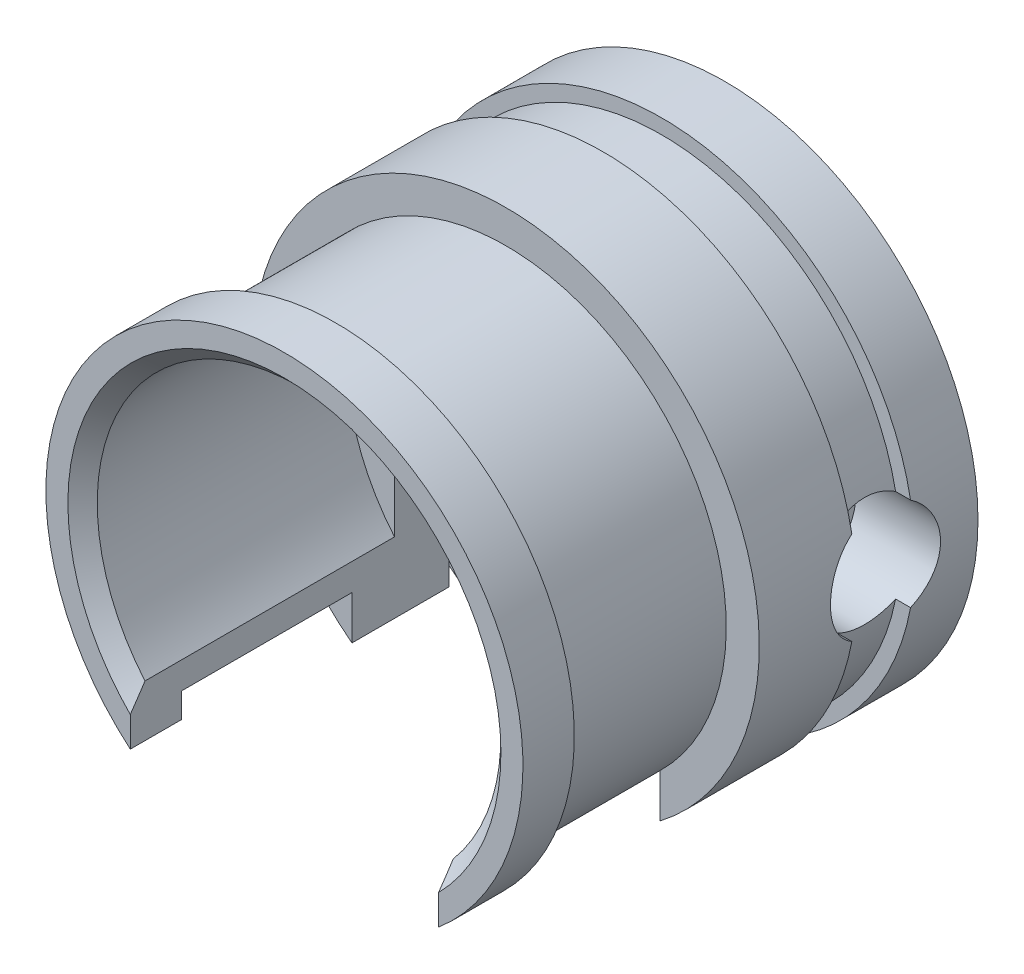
ISO-10303-21;
HEADER;
FILE_DESCRIPTION(('STEP AP214'),'2;1');
FILE_NAME('part.step','',(''),(''),'','','');
FILE_SCHEMA(('AUTOMOTIVE_DESIGN { 1 0 10303 214 1 1 1 1 }'));
ENDSEC;
DATA;
#1=APPLICATION_CONTEXT('core data for automotive mechanical design processes');
#2=APPLICATION_PROTOCOL_DEFINITION('international standard','automotive_design',2000,#1);
#3=PRODUCT_CONTEXT('',#1,'mechanical');
#4=PRODUCT('Part','Part','',(#3));
#5=PRODUCT_RELATED_PRODUCT_CATEGORY('part','',(#4));
#6=PRODUCT_DEFINITION_FORMATION('','',#4);
#7=PRODUCT_DEFINITION_CONTEXT('part definition',#1,'design');
#8=PRODUCT_DEFINITION('design','',#6,#7);
#9=PRODUCT_DEFINITION_SHAPE('','',#8);
#10=(LENGTH_UNIT() NAMED_UNIT(*) SI_UNIT(.MILLI.,.METRE.));
#11=(NAMED_UNIT(*) PLANE_ANGLE_UNIT() SI_UNIT($,.RADIAN.));
#12=(NAMED_UNIT(*) SI_UNIT($,.STERADIAN.) SOLID_ANGLE_UNIT());
#13=UNCERTAINTY_MEASURE_WITH_UNIT(LENGTH_MEASURE(1.E-05),#10,'distance_accuracy_value','');
#14=(GEOMETRIC_REPRESENTATION_CONTEXT(3) GLOBAL_UNCERTAINTY_ASSIGNED_CONTEXT((#13)) GLOBAL_UNIT_ASSIGNED_CONTEXT((#10,
#11,#12)) REPRESENTATION_CONTEXT('',''));
#15=CARTESIAN_POINT('',(0.,0.,0.));
#16=DIRECTION('',(0.,0.,1.));
#17=DIRECTION('',(1.,0.,0.));
#18=AXIS2_PLACEMENT_3D('',#15,#16,#17);
#19=CARTESIAN_POINT('',(0.,0.,38.1));
#20=DIRECTION('',(0.,0.,-1.));
#21=DIRECTION('',(-1.,0.,0.));
#22=AXIS2_PLACEMENT_3D('',#19,#20,#21);
#23=CYLINDRICAL_SURFACE('',#22,21.9075);
#24=CARTESIAN_POINT('',(0.,0.,0.));
#25=DIRECTION('',(0.,0.,1.));
#26=DIRECTION('',(1.,0.,0.));
#27=AXIS2_PLACEMENT_3D('',#24,#25,#26);
#28=CIRCLE('',#27,21.9075);
#29=CARTESIAN_POINT('',(21.9075,0.,0.));
#30=VERTEX_POINT('',#29);
#31=EDGE_CURVE('E529',#30,#30,#28,.T.);
#32=ORIENTED_EDGE('',*,*,#31,.T.);
#33=EDGE_LOOP('',(#32));
#34=FACE_BOUND('',#33,.T.);
#35=CARTESIAN_POINT('',(0.,0.,5.461));
#36=DIRECTION('',(0.,0.,1.));
#37=DIRECTION('',(1.,0.,0.));
#38=AXIS2_PLACEMENT_3D('',#35,#36,#37);
#39=CIRCLE('',#38,21.9075);
#40=CARTESIAN_POINT('',(21.5338976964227,4.02862336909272,5.461));
#41=VERTEX_POINT('',#40);
#42=CARTESIAN_POINT('',(-21.5338976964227,4.02862336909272,5.461));
#43=VERTEX_POINT('',#42);
#44=EDGE_CURVE('E444',#41,#43,#39,.T.);
#45=ORIENTED_EDGE('',*,*,#44,.F.);
#46=CARTESIAN_POINT('',(21.9075,0.,3.2385));
#47=CARTESIAN_POINT('',(21.9074951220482,-0.264181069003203,3.23850907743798));
#48=CARTESIAN_POINT('',(21.9026727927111,-0.528472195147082,3.26055583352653));
#49=CARTESIAN_POINT('',(21.8839013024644,-1.04955005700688,3.34807039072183));
#50=CARTESIAN_POINT('',(21.8699455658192,-1.30633124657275,3.4135694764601));
#51=CARTESIAN_POINT('',(21.8344614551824,-1.80478301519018,3.58584238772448));
#52=CARTESIAN_POINT('',(21.8129409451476,-2.04646898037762,3.69257336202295));
#53=CARTESIAN_POINT('',(21.7646511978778,-2.50849402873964,3.94414499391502));
#54=CARTESIAN_POINT('',(21.7378821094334,-2.72883371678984,4.0889845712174));
#55=CARTESIAN_POINT('',(21.6815539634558,-3.14541573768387,4.4150935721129));
#56=CARTESIAN_POINT('',(21.6519606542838,-3.34127098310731,4.59685160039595));
#57=CARTESIAN_POINT('',(21.5935613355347,-3.69996845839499,4.99058901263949));
#58=CARTESIAN_POINT('',(21.5647553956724,-3.86280777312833,5.20257106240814));
#59=CARTESIAN_POINT('',(21.5108548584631,-4.15255438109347,5.65359541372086));
#60=CARTESIAN_POINT('',(21.4858041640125,-4.27905042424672,5.89290762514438));
#61=CARTESIAN_POINT('',(21.4427416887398,-4.48988201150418,6.39002677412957));
#62=CARTESIAN_POINT('',(21.4247290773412,-4.57422253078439,6.64783152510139));
#63=CARTESIAN_POINT('',(21.3981308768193,-4.69707134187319,7.1704211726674));
#64=CARTESIAN_POINT('',(21.3894045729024,-4.73626452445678,7.43503775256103));
#65=CARTESIAN_POINT('',(21.3819443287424,-4.7698355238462,7.96722324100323));
#66=CARTESIAN_POINT('',(21.3832091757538,-4.76421877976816,8.23479178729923));
#67=CARTESIAN_POINT('',(21.3954608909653,-4.70888071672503,8.76020028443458));
#68=CARTESIAN_POINT('',(21.4062725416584,-4.65995424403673,9.01812865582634));
#69=CARTESIAN_POINT('',(21.4361227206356,-4.52064450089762,9.52202651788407));
#70=CARTESIAN_POINT('',(21.4551617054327,-4.43025892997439,9.76799534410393));
#71=CARTESIAN_POINT('',(21.4994944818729,-4.20986471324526,10.2432306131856));
#72=CARTESIAN_POINT('',(21.5248363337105,-4.07954974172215,10.4723503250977));
#73=CARTESIAN_POINT('',(21.5788898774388,-3.7832113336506,10.9057647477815));
#74=CARTESIAN_POINT('',(21.6076020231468,-3.61718308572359,11.1100561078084));
#75=CARTESIAN_POINT('',(21.6659133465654,-3.24991998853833,11.4925916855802));
#76=CARTESIAN_POINT('',(21.695518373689,-3.04800906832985,11.6701865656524));
#77=CARTESIAN_POINT('',(21.7517211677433,-2.61693587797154,11.9890990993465));
#78=CARTESIAN_POINT('',(21.7783188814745,-2.38777312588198,12.1304161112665));
#79=CARTESIAN_POINT('',(21.8255948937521,-1.90791406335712,12.3729188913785));
#80=CARTESIAN_POINT('',(21.8462607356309,-1.65717385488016,12.4740203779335));
#81=CARTESIAN_POINT('',(21.8792518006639,-1.14171493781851,12.6324755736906));
#82=CARTESIAN_POINT('',(21.8915782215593,-0.876998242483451,12.6898355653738));
#83=CARTESIAN_POINT('',(21.906331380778,-0.346671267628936,12.7582369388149));
#84=CARTESIAN_POINT('',(21.9089476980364,-0.0811805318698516,12.7701654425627));
#85=CARTESIAN_POINT('',(21.9045167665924,0.448000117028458,12.7497685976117));
#86=CARTESIAN_POINT('',(21.8974701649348,0.711690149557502,12.7174462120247));
#87=CARTESIAN_POINT('',(21.8746247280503,1.22685061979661,12.6102008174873));
#88=CARTESIAN_POINT('',(21.8589213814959,1.47842237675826,12.5357423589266));
#89=CARTESIAN_POINT('',(21.8205198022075,1.96550603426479,12.3468534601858));
#90=CARTESIAN_POINT('',(21.7978209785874,2.20101657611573,12.2324196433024));
#91=CARTESIAN_POINT('',(21.7474782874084,2.65296618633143,11.9649747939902));
#92=CARTESIAN_POINT('',(21.7197690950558,2.86908885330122,11.8114416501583));
#93=CARTESIAN_POINT('',(21.6626140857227,3.27282083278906,11.4708447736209));
#94=CARTESIAN_POINT('',(21.6331680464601,3.46042648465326,11.2837767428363));
#95=CARTESIAN_POINT('',(21.5752044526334,3.80530014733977,10.8773517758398));
#96=CARTESIAN_POINT('',(21.5467135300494,3.96195424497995,10.6574694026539));
#97=CARTESIAN_POINT('',(21.4944981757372,4.23611381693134,10.1939950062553));
#98=CARTESIAN_POINT('',(21.4707735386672,4.35362097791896,9.95040400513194));
#99=CARTESIAN_POINT('',(21.4310016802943,4.54536253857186,9.44772906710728));
#100=CARTESIAN_POINT('',(21.4149115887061,4.61983909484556,9.18874105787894));
#101=CARTESIAN_POINT('',(21.3921522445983,4.72411675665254,8.66153220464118));
#102=CARTESIAN_POINT('',(21.3854815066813,4.75392490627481,8.39331282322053));
#103=CARTESIAN_POINT('',(21.3824089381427,4.76772266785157,7.86144290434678));
#104=CARTESIAN_POINT('',(21.3857890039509,4.75268540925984,7.59781840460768));
#105=CARTESIAN_POINT('',(21.4019443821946,4.67939265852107,7.07695579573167));
#106=CARTESIAN_POINT('',(21.4147195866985,4.6211376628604,6.81971761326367));
#107=CARTESIAN_POINT('',(21.4481201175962,4.46353062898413,6.31969130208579));
#108=CARTESIAN_POINT('',(21.4687186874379,4.36431856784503,6.0768571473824));
#109=CARTESIAN_POINT('',(21.5154558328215,4.12773453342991,5.61113553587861));
#110=CARTESIAN_POINT('',(21.5415949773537,3.99035864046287,5.38825013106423));
#111=CARTESIAN_POINT('',(21.5971207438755,3.67811174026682,4.96395216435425));
#112=CARTESIAN_POINT('',(21.6265618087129,3.50254652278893,4.76305750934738));
#113=CARTESIAN_POINT('',(21.6850065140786,3.12031346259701,4.39326132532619));
#114=CARTESIAN_POINT('',(21.7140100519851,2.91363844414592,4.2243671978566));
#115=CARTESIAN_POINT('',(21.7687512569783,2.4718699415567,3.92130184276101));
#116=CARTESIAN_POINT('',(21.7944424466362,2.2364470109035,3.78760198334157));
#117=CARTESIAN_POINT('',(21.8391986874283,1.74596266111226,3.56188171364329));
#118=CARTESIAN_POINT('',(21.8582693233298,1.4909180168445,3.46982615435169));
#119=CARTESIAN_POINT('',(21.8842105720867,1.02966202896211,3.34651958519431));
#120=CARTESIAN_POINT('',(21.8928902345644,0.825956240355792,3.30608914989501));
#121=CARTESIAN_POINT('',(21.9045367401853,0.414856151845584,3.25207637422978));
#122=CARTESIAN_POINT('',(21.9075038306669,0.207462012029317,3.2384928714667));
#123=CARTESIAN_POINT('',(21.9075,0.,3.2385));
#124=B_SPLINE_CURVE_WITH_KNOTS('',3,(#46,#47,#48,#49,#50,#51,#52,#53,#54,#55,#56,#57,#58,#59,
#60,#61,#62,#63,#64,#65,#66,#67,#68,#69,#70,#71,#72,#73,#74,#75,#76,#77,#78,#79,#80,#81,#82,#83,
#84,#85,#86,#87,#88,#89,#90,#91,#92,#93,#94,#95,#96,#97,#98,#99,#100,#101,#102,#103,#104,#105,
#106,#107,#108,#109,#110,#111,#112,#113,#114,#115,#116,#117,#118,#119,#120,#121,#122,#123),
.UNSPECIFIED.,.T.,.F.,(4,2,2,2,2,2,2,2,2,2,2,2,2,2,2,2,2,2,2,2,2,2,2,2,2,2,2,2,2,2,2,2,2,2,2,2,
2,2,4),(0.,0.791783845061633,1.58413837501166,2.37567163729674,3.16718246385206,
3.96994514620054,4.77277867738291,5.58436805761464,6.39586163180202,7.19487553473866,
7.99379245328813,8.77834430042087,9.56293968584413,10.3537116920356,11.144590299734,
11.9523566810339,12.7601373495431,13.5696021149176,14.378950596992,15.1724117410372,
15.9658197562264,16.7506462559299,17.5355390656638,18.3315193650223,19.1276017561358,
19.9381648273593,20.7486929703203,21.5546142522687,22.3604084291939,23.1488452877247,
23.9372730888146,24.7230283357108,25.5088643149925,26.3103988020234,27.1121184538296,
27.9240845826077,28.7353641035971,29.3571807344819,29.9789704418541),.UNSPECIFIED.);
#125=CARTESIAN_POINT('',(21.5338976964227,-4.02862336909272,5.461));
#126=VERTEX_POINT('',#125);
#127=EDGE_CURVE('E321',#41,#126,#124,.T.);
#128=ORIENTED_EDGE('',*,*,#127,.T.);
#129=CARTESIAN_POINT('',(-21.5338976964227,-4.02862336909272,5.461));
#130=VERTEX_POINT('',#129);
#131=EDGE_CURVE('E314',#130,#126,#39,.T.);
#132=ORIENTED_EDGE('',*,*,#131,.F.);
#133=CARTESIAN_POINT('',(-21.9075,0.,12.7635));
#134=CARTESIAN_POINT('',(-21.9074951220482,-0.264181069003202,12.763490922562));
#135=CARTESIAN_POINT('',(-21.9026727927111,-0.528472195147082,12.7414441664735));
#136=CARTESIAN_POINT('',(-21.8839013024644,-1.04955005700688,12.6539296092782));
#137=CARTESIAN_POINT('',(-21.8699455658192,-1.30633124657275,12.5884305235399));
#138=CARTESIAN_POINT('',(-21.8344614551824,-1.80478301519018,12.4161576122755));
#139=CARTESIAN_POINT('',(-21.8129409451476,-2.04646898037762,12.309426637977));
#140=CARTESIAN_POINT('',(-21.7646511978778,-2.50849402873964,12.057855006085));
#141=CARTESIAN_POINT('',(-21.7378821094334,-2.72883371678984,11.9130154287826));
#142=CARTESIAN_POINT('',(-21.6815539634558,-3.14541573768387,11.5869064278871));
#143=CARTESIAN_POINT('',(-21.6519606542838,-3.34127098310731,11.4051483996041));
#144=CARTESIAN_POINT('',(-21.5935613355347,-3.69996845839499,11.0114109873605));
#145=CARTESIAN_POINT('',(-21.5647553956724,-3.86280777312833,10.7994289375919));
#146=CARTESIAN_POINT('',(-21.5108548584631,-4.15255438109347,10.3484045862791));
#147=CARTESIAN_POINT('',(-21.4858041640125,-4.27905042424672,10.1090923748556));
#148=CARTESIAN_POINT('',(-21.4427416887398,-4.48988201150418,9.61197322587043));
#149=CARTESIAN_POINT('',(-21.4247290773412,-4.57422253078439,9.35416847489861));
#150=CARTESIAN_POINT('',(-21.3981308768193,-4.69707134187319,8.83157882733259));
#151=CARTESIAN_POINT('',(-21.3894045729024,-4.73626452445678,8.56696224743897));
#152=CARTESIAN_POINT('',(-21.3819443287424,-4.7698355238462,8.03477675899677));
#153=CARTESIAN_POINT('',(-21.3832091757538,-4.76421877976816,7.76720821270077));
#154=CARTESIAN_POINT('',(-21.3954608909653,-4.70888071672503,7.24179971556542));
#155=CARTESIAN_POINT('',(-21.4062725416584,-4.65995424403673,6.98387134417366));
#156=CARTESIAN_POINT('',(-21.4361227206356,-4.52064450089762,6.47997348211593));
#157=CARTESIAN_POINT('',(-21.4551617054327,-4.43025892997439,6.23400465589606));
#158=CARTESIAN_POINT('',(-21.4994944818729,-4.20986471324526,5.75876938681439));
#159=CARTESIAN_POINT('',(-21.5248363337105,-4.07954974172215,5.52964967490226));
#160=CARTESIAN_POINT('',(-21.5788898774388,-3.7832113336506,5.0962352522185));
#161=CARTESIAN_POINT('',(-21.6076020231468,-3.61718308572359,4.8919438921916));
#162=CARTESIAN_POINT('',(-21.6659133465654,-3.24991998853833,4.50940831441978));
#163=CARTESIAN_POINT('',(-21.695518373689,-3.04800906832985,4.33181343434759));
#164=CARTESIAN_POINT('',(-21.7517211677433,-2.61693587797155,4.01290090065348));
#165=CARTESIAN_POINT('',(-21.7783188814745,-2.38777312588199,3.87158388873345));
#166=CARTESIAN_POINT('',(-21.8255948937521,-1.90791406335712,3.62908110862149));
#167=CARTESIAN_POINT('',(-21.8462607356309,-1.65717385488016,3.52797962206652));
#168=CARTESIAN_POINT('',(-21.8792518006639,-1.14171493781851,3.36952442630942));
#169=CARTESIAN_POINT('',(-21.8915782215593,-0.876998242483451,3.31216443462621));
#170=CARTESIAN_POINT('',(-21.906331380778,-0.346671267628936,3.24376306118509));
#171=CARTESIAN_POINT('',(-21.9089476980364,-0.0811805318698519,3.23183455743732));
#172=CARTESIAN_POINT('',(-21.9045167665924,0.448000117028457,3.25223140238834));
#173=CARTESIAN_POINT('',(-21.8974701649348,0.711690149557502,3.28455378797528));
#174=CARTESIAN_POINT('',(-21.8746247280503,1.22685061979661,3.39179918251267));
#175=CARTESIAN_POINT('',(-21.8589213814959,1.47842237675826,3.46625764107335));
#176=CARTESIAN_POINT('',(-21.8205198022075,1.96550603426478,3.65514653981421));
#177=CARTESIAN_POINT('',(-21.7978209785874,2.20101657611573,3.76958035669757));
#178=CARTESIAN_POINT('',(-21.7474782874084,2.65296618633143,4.03702520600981));
#179=CARTESIAN_POINT('',(-21.7197690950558,2.86908885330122,4.19055834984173));
#180=CARTESIAN_POINT('',(-21.6626140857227,3.27282083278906,4.53115522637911));
#181=CARTESIAN_POINT('',(-21.6331680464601,3.46042648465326,4.71822325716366));
#182=CARTESIAN_POINT('',(-21.5752044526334,3.80530014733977,5.12464822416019));
#183=CARTESIAN_POINT('',(-21.5467135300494,3.96195424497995,5.34453059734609));
#184=CARTESIAN_POINT('',(-21.4944981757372,4.23611381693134,5.80800499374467));
#185=CARTESIAN_POINT('',(-21.4707735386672,4.35362097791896,6.05159599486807));
#186=CARTESIAN_POINT('',(-21.4310016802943,4.54536253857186,6.55427093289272));
#187=CARTESIAN_POINT('',(-21.4149115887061,4.61983909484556,6.81325894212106));
#188=CARTESIAN_POINT('',(-21.3921522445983,4.72411675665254,7.34046779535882));
#189=CARTESIAN_POINT('',(-21.3854815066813,4.75392490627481,7.60868717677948));
#190=CARTESIAN_POINT('',(-21.3824089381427,4.76772266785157,8.14055709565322));
#191=CARTESIAN_POINT('',(-21.3857890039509,4.75268540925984,8.40418159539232));
#192=CARTESIAN_POINT('',(-21.4019443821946,4.67939265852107,8.92504420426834));
#193=CARTESIAN_POINT('',(-21.4147195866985,4.6211376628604,9.18228238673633));
#194=CARTESIAN_POINT('',(-21.4481201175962,4.46353062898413,9.68230869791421));
#195=CARTESIAN_POINT('',(-21.4687186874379,4.36431856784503,9.9251428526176));
#196=CARTESIAN_POINT('',(-21.5154558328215,4.12773453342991,10.3908644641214));
#197=CARTESIAN_POINT('',(-21.5415949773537,3.99035864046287,10.6137498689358));
#198=CARTESIAN_POINT('',(-21.5971207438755,3.67811174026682,11.0380478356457));
#199=CARTESIAN_POINT('',(-21.6265618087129,3.50254652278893,11.2389424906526));
#200=CARTESIAN_POINT('',(-21.6850065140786,3.12031346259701,11.6087386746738));
#201=CARTESIAN_POINT('',(-21.7140100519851,2.91363844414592,11.7776328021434));
#202=CARTESIAN_POINT('',(-21.7687512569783,2.4718699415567,12.080698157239));
#203=CARTESIAN_POINT('',(-21.7944424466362,2.2364470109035,12.2143980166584));
#204=CARTESIAN_POINT('',(-21.8391986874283,1.74596266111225,12.4401182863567));
#205=CARTESIAN_POINT('',(-21.8582693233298,1.4909180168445,12.5321738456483));
#206=CARTESIAN_POINT('',(-21.8842105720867,1.02966202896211,12.6554804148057));
#207=CARTESIAN_POINT('',(-21.8928902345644,0.825956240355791,12.695910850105));
#208=CARTESIAN_POINT('',(-21.9045367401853,0.414856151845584,12.7499236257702));
#209=CARTESIAN_POINT('',(-21.9075038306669,0.207462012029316,12.7635071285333));
#210=CARTESIAN_POINT('',(-21.9075,0.,12.7635));
#211=B_SPLINE_CURVE_WITH_KNOTS('',3,(#133,#134,#135,#136,#137,#138,#139,#140,#141,#142,#143,
#144,#145,#146,#147,#148,#149,#150,#151,#152,#153,#154,#155,#156,#157,#158,#159,#160,#161,#162,
#163,#164,#165,#166,#167,#168,#169,#170,#171,#172,#173,#174,#175,#176,#177,#178,#179,#180,#181,
#182,#183,#184,#185,#186,#187,#188,#189,#190,#191,#192,#193,#194,#195,#196,#197,#198,#199,#200,
#201,#202,#203,#204,#205,#206,#207,#208,#209,#210),.UNSPECIFIED.,.T.,.F.,(4,2,2,2,2,2,2,2,2,2,2,
2,2,2,2,2,2,2,2,2,2,2,2,2,2,2,2,2,2,2,2,2,2,2,2,2,2,2,4),(0.,0.791783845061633,1.58413837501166,
2.37567163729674,3.16718246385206,3.96994514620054,4.77277867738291,5.58436805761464,
6.39586163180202,7.19487553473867,7.99379245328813,8.77834430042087,9.56293968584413,
10.3537116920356,11.144590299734,11.9523566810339,12.7601373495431,13.5696021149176,
14.378950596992,15.1724117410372,15.9658197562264,16.7506462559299,17.5355390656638,
18.3315193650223,19.1276017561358,19.9381648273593,20.7486929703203,21.5546142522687,
22.3604084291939,23.1488452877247,23.9372730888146,24.7230283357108,25.5088643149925,
26.3103988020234,27.1121184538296,27.9240845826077,28.7353641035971,29.3571807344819,
29.9789704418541),.UNSPECIFIED.);
#212=EDGE_CURVE('E512',#130,#43,#211,.T.);
#213=ORIENTED_EDGE('',*,*,#212,.T.);
#214=EDGE_LOOP('',(#45,#128,#132,#213));
#215=FACE_BOUND('',#214,.T.);
#216=ADVANCED_FACE('F162',(#34,#215),#23,.T.);
#217=CARTESIAN_POINT('',(0.,0.,10.541));
#218=DIRECTION('',(0.,0.,1.));
#219=DIRECTION('',(1.,0.,0.));
#220=AXIS2_PLACEMENT_3D('',#217,#218,#219);
#221=CIRCLE('',#220,21.9075);
#222=CARTESIAN_POINT('',(21.5338976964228,4.02862336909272,10.541));
#223=VERTEX_POINT('',#222);
#224=CARTESIAN_POINT('',(-21.5338976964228,4.02862336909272,10.541));
#225=VERTEX_POINT('',#224);
#226=EDGE_CURVE('E496',#223,#225,#221,.T.);
#227=ORIENTED_EDGE('',*,*,#226,.T.);
#228=CARTESIAN_POINT('',(-21.5338976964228,-4.02862336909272,10.541));
#229=VERTEX_POINT('',#228);
#230=EDGE_CURVE('E433',#225,#229,#211,.T.);
#231=ORIENTED_EDGE('',*,*,#230,.T.);
#232=CARTESIAN_POINT('',(-13.335,-17.3814939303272,10.541));
#233=VERTEX_POINT('',#232);
#234=EDGE_CURVE('E507',#229,#233,#221,.T.);
#235=ORIENTED_EDGE('',*,*,#234,.T.);
#236=DIRECTION('',(0.,0.,-1.));
#237=VECTOR('',#236,1.);
#238=CARTESIAN_POINT('',(-13.335,-17.3814939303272,38.1));
#239=LINE('',#238,#237);
#240=CARTESIAN_POINT('',(-13.335,-17.3814939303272,18.923));
#241=VERTEX_POINT('',#240);
#242=EDGE_CURVE('E358',#241,#233,#239,.T.);
#243=ORIENTED_EDGE('',*,*,#242,.F.);
#244=CARTESIAN_POINT('',(0.,0.,18.923));
#245=DIRECTION('',(0.,0.,1.));
#246=DIRECTION('',(1.,0.,0.));
#247=AXIS2_PLACEMENT_3D('',#244,#245,#246);
#248=CIRCLE('',#247,21.9075);
#249=CARTESIAN_POINT('',(13.335,-17.3814939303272,18.923));
#250=VERTEX_POINT('',#249);
#251=EDGE_CURVE('E348',#250,#241,#248,.T.);
#252=ORIENTED_EDGE('',*,*,#251,.F.);
#253=DIRECTION('',(0.,0.,-1.));
#254=VECTOR('',#253,1.);
#255=CARTESIAN_POINT('',(13.335,-17.3814939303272,38.1));
#256=LINE('',#255,#254);
#257=CARTESIAN_POINT('',(13.335,-17.3814939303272,10.541));
#258=VERTEX_POINT('',#257);
#259=EDGE_CURVE('E386',#258,#250,#256,.F.);
#260=ORIENTED_EDGE('',*,*,#259,.F.);
#261=CARTESIAN_POINT('',(21.5338976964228,-4.02862336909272,10.541));
#262=VERTEX_POINT('',#261);
#263=EDGE_CURVE('E509',#258,#262,#221,.T.);
#264=ORIENTED_EDGE('',*,*,#263,.T.);
#265=EDGE_CURVE('E506',#262,#223,#124,.T.);
#266=ORIENTED_EDGE('',*,*,#265,.T.);
#267=EDGE_LOOP('',(#227,#231,#235,#243,#252,#260,#264,#266));
#268=FACE_BOUND('',#267,.T.);
#269=ADVANCED_FACE('F502',(#268),#23,.T.);
#270=CARTESIAN_POINT('',(14.605,0.,8.001));
#271=DIRECTION('',(1.,0.,0.));
#272=DIRECTION('',(0.,0.,-1.));
#273=AXIS2_PLACEMENT_3D('',#270,#271,#272);
#274=CYLINDRICAL_SURFACE('',#273,4.7625);
#275=CARTESIAN_POINT('',(14.605,0.,8.001));
#276=DIRECTION('',(1.,0.,0.));
#277=DIRECTION('',(0.,0.,-1.));
#278=AXIS2_PLACEMENT_3D('',#275,#276,#277);
#279=CIRCLE('',#278,4.7625);
#280=CARTESIAN_POINT('',(14.605,0.,3.2385));
#281=VERTEX_POINT('',#280);
#282=EDGE_CURVE('E515',#281,#281,#279,.T.);
#283=ORIENTED_EDGE('',*,*,#282,.F.);
#284=EDGE_LOOP('',(#283));
#285=FACE_BOUND('',#284,.T.);
#286=DIRECTION('',(1.,0.,0.));
#287=VECTOR('',#286,1.);
#288=CARTESIAN_POINT('',(14.605,4.02862336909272,5.461));
#289=LINE('',#288,#287);
#290=CARTESIAN_POINT('',(20.2404693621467,4.02862336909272,5.461));
#291=VERTEX_POINT('',#290);
#292=EDGE_CURVE('E311',#291,#41,#289,.T.);
#293=ORIENTED_EDGE('',*,*,#292,.F.);
#294=CARTESIAN_POINT('',(20.6375,0.,3.2385));
#295=CARTESIAN_POINT('',(20.6374952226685,-0.263766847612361,3.23850846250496));
#296=CARTESIAN_POINT('',(20.6323921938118,-0.527632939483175,3.26048664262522));
#297=CARTESIAN_POINT('',(20.6125286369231,-1.04784503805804,3.34771251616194));
#298=CARTESIAN_POINT('',(20.5977617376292,-1.30418596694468,3.41298875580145));
#299=CARTESIAN_POINT('',(20.5602113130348,-1.80175662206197,3.58463754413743));
#300=CARTESIAN_POINT('',(20.5374366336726,-2.04300267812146,3.69096475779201));
#301=CARTESIAN_POINT('',(20.4863165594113,-2.50422713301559,3.94154744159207));
#302=CARTESIAN_POINT('',(20.4579711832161,-2.72420560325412,4.08580278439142));
#303=CARTESIAN_POINT('',(20.3982422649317,-3.14055872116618,4.41085367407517));
#304=CARTESIAN_POINT('',(20.3668175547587,-3.3365020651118,4.5921941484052));
#305=CARTESIAN_POINT('',(20.3047555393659,-3.69547966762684,4.98509901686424));
#306=CARTESIAN_POINT('',(20.274118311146,-3.85851071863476,5.19666635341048));
#307=CARTESIAN_POINT('',(20.2166910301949,-4.14898509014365,5.64726749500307));
#308=CARTESIAN_POINT('',(20.1899535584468,-4.27596063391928,5.88661015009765));
#309=CARTESIAN_POINT('',(20.1439477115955,-4.48771630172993,6.38395693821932));
#310=CARTESIAN_POINT('',(20.1246783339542,-4.57250208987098,6.64195856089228));
#311=CARTESIAN_POINT('',(20.096211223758,-4.69602897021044,7.16459642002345));
#312=CARTESIAN_POINT('',(20.0868456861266,-4.73553820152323,7.42904176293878));
#313=CARTESIAN_POINT('',(20.0787433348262,-4.76978049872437,7.96096035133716));
#314=CARTESIAN_POINT('',(20.0800050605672,-4.76451971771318,8.22843317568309));
#315=CARTESIAN_POINT('',(20.0928631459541,-4.70998750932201,8.75303941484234));
#316=CARTESIAN_POINT('',(20.1042479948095,-4.66161676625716,9.01027243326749));
#317=CARTESIAN_POINT('',(20.1357341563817,-4.52366829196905,9.51287083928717));
#318=CARTESIAN_POINT('',(20.1558360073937,-4.43408801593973,9.7582354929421));
#319=CARTESIAN_POINT('',(20.2026942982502,-4.21545858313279,10.2326207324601));
#320=CARTESIAN_POINT('',(20.2295075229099,-4.08607035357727,10.4614792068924));
#321=CARTESIAN_POINT('',(20.2867336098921,-3.79173577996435,10.8945655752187));
#322=CARTESIAN_POINT('',(20.3171470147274,-3.62678407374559,11.0987897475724));
#323=CARTESIAN_POINT('',(20.3790479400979,-3.26127494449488,11.4819872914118));
#324=CARTESIAN_POINT('',(20.4105436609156,-3.05995371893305,11.6602315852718));
#325=CARTESIAN_POINT('',(20.4703939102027,-2.62991168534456,11.9805547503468));
#326=CARTESIAN_POINT('',(20.4987483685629,-2.40119026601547,12.1226328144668));
#327=CARTESIAN_POINT('',(20.5492303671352,-1.92189505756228,12.366802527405));
#328=CARTESIAN_POINT('',(20.5713416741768,-1.67126647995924,12.4687901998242));
#329=CARTESIAN_POINT('',(20.6067265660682,-1.15580285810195,12.6289947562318));
#330=CARTESIAN_POINT('',(20.6200015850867,-0.890970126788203,12.6872187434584));
#331=CARTESIAN_POINT('',(20.63601101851,-0.360862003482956,12.7571631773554));
#332=CARTESIAN_POINT('',(20.6389708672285,-0.0957244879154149,12.7698783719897));
#333=CARTESIAN_POINT('',(20.6346520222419,0.432887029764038,12.7511523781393));
#334=CARTESIAN_POINT('',(20.6273741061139,0.696361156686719,12.7197145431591));
#335=CARTESIAN_POINT('',(20.6035405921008,1.21081134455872,12.6143982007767));
#336=CARTESIAN_POINT('',(20.5871008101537,1.46190165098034,12.5410492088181));
#337=CARTESIAN_POINT('',(20.5467874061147,1.9482105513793,12.3545867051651));
#338=CARTESIAN_POINT('',(20.5229131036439,2.18342769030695,12.2414695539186));
#339=CARTESIAN_POINT('',(20.4698281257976,2.63536942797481,11.976663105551));
#340=CARTESIAN_POINT('',(20.4405399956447,2.85174820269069,11.824399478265));
#341=CARTESIAN_POINT('',(20.380019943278,3.25623929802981,11.4863701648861));
#342=CARTESIAN_POINT('',(20.3487877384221,3.44434749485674,11.3005995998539));
#343=CARTESIAN_POINT('',(20.2871085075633,3.79095326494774,10.8962431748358));
#344=CARTESIAN_POINT('',(20.256691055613,3.94875840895,10.6770583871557));
#345=CARTESIAN_POINT('',(20.2008164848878,4.22532922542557,10.21471833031));
#346=CARTESIAN_POINT('',(20.1753591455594,4.34409663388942,9.9715641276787));
#347=CARTESIAN_POINT('',(20.1325464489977,4.53837887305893,9.46951373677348));
#348=CARTESIAN_POINT('',(20.1151441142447,4.61414509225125,9.21071903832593));
#349=CARTESIAN_POINT('',(20.0903395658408,4.72098784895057,8.6836123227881));
#350=CARTESIAN_POINT('',(20.082935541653,4.75207247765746,8.4153020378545));
#351=CARTESIAN_POINT('',(20.0790890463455,4.76829551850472,7.88378462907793));
#352=CARTESIAN_POINT('',(20.0823839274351,4.75453480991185,7.62061242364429));
#353=CARTESIAN_POINT('',(20.0989650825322,4.68394052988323,7.10044719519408));
#354=CARTESIAN_POINT('',(20.1122512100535,4.6271075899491,6.84345408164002));
#355=CARTESIAN_POINT('',(20.1471828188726,4.47254060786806,6.34393603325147));
#356=CARTESIAN_POINT('',(20.168792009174,4.37498398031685,6.10135349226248));
#357=CARTESIAN_POINT('',(20.2179454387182,4.14188536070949,5.63584151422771));
#358=CARTESIAN_POINT('',(20.2454903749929,4.00633890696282,5.41291438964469));
#359=CARTESIAN_POINT('',(20.3041830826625,3.69753132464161,4.98765344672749));
#360=CARTESIAN_POINT('',(20.3353977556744,3.52349314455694,4.78589302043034));
#361=CARTESIAN_POINT('',(20.397482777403,3.14419524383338,4.41408106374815));
#362=CARTESIAN_POINT('',(20.4283530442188,2.93892825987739,4.24403693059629));
#363=CARTESIAN_POINT('',(20.4868144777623,2.49933438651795,3.93805642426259));
#364=CARTESIAN_POINT('',(20.5143503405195,2.26462230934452,3.80266219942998));
#365=CARTESIAN_POINT('',(20.5624761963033,1.77517311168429,3.57346520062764));
#366=CARTESIAN_POINT('',(20.5830717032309,1.52045208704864,3.4796293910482));
#367=CARTESIAN_POINT('',(20.6115514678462,1.05476793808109,3.35191584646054));
#368=CARTESIAN_POINT('',(20.6212195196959,0.846221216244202,3.30946991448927));
#369=CARTESIAN_POINT('',(20.6341955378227,0.425137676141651,3.25275934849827));
#370=CARTESIAN_POINT('',(20.6375038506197,0.212601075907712,3.23849317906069));
#371=CARTESIAN_POINT('',(20.6375,0.,3.2385));
#372=B_SPLINE_CURVE_WITH_KNOTS('',3,(#294,#295,#296,#297,#298,#299,#300,#301,#302,#303,#304,
#305,#306,#307,#308,#309,#310,#311,#312,#313,#314,#315,#316,#317,#318,#319,#320,#321,#322,#323,
#324,#325,#326,#327,#328,#329,#330,#331,#332,#333,#334,#335,#336,#337,#338,#339,#340,#341,#342,
#343,#344,#345,#346,#347,#348,#349,#350,#351,#352,#353,#354,#355,#356,#357,#358,#359,#360,#361,
#362,#363,#364,#365,#366,#367,#368,#369,#370,#371),.UNSPECIFIED.,.T.,.F.,(4,2,2,2,2,2,2,2,2,2,2,
2,2,2,2,2,2,2,2,2,2,2,2,2,2,2,2,2,2,2,2,2,2,2,2,2,2,2,4),(0.,0.790522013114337,1.58156573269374,
2.37173834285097,3.16190829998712,3.96465203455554,4.76747396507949,5.58027967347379,
6.39297623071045,7.19167078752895,7.99025557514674,8.77253699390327,9.55486672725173,
10.3440537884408,11.133359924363,11.9417314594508,12.7501210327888,13.5605935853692,
14.3709345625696,15.1634507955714,15.9559068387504,16.7385654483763,17.5212957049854,
18.3162395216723,19.1112991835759,19.9227929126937,20.7342505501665,21.5409141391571,
22.3474316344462,23.13430099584,23.9211588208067,24.7046238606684,25.4881809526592,
26.2892960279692,27.0905977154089,27.9037608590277,28.7162764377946,29.353486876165,
29.9906625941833),.UNSPECIFIED.);
#373=CARTESIAN_POINT('',(20.2404693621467,4.02862336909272,10.541));
#374=VERTEX_POINT('',#373);
#375=EDGE_CURVE('E298',#374,#291,#372,.T.);
#376=ORIENTED_EDGE('',*,*,#375,.F.);
#377=DIRECTION('',(1.,0.,0.));
#378=VECTOR('',#377,1.);
#379=CARTESIAN_POINT('',(14.605,4.02862336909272,10.541));
#380=LINE('',#379,#378);
#381=EDGE_CURVE('E323',#223,#374,#380,.F.);
#382=ORIENTED_EDGE('',*,*,#381,.F.);
#383=ORIENTED_EDGE('',*,*,#265,.F.);
#384=DIRECTION('',(1.,0.,0.));
#385=VECTOR('',#384,1.);
#386=CARTESIAN_POINT('',(14.605,-4.02862336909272,10.541));
#387=LINE('',#386,#385);
#388=CARTESIAN_POINT('',(20.2404693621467,-4.02862336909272,10.541));
#389=VERTEX_POINT('',#388);
#390=EDGE_CURVE('E327',#389,#262,#387,.T.);
#391=ORIENTED_EDGE('',*,*,#390,.F.);
#392=CARTESIAN_POINT('',(20.2404693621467,-4.02862336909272,5.461));
#393=VERTEX_POINT('',#392);
#394=EDGE_CURVE('E306',#393,#389,#372,.T.);
#395=ORIENTED_EDGE('',*,*,#394,.F.);
#396=DIRECTION('',(1.,0.,0.));
#397=VECTOR('',#396,1.);
#398=CARTESIAN_POINT('',(14.605,-4.02862336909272,5.461));
#399=LINE('',#398,#397);
#400=EDGE_CURVE('E322',#126,#393,#399,.F.);
#401=ORIENTED_EDGE('',*,*,#400,.F.);
#402=ORIENTED_EDGE('',*,*,#127,.F.);
#403=EDGE_LOOP('',(#293,#376,#382,#383,#391,#395,#401,#402));
#404=FACE_BOUND('',#403,.T.);
#405=ADVANCED_FACE('F318',(#285,#404),#274,.F.);
#406=CARTESIAN_POINT('',(-31.4325,0.,8.001));
#407=DIRECTION('',(1.,0.,0.));
#408=DIRECTION('',(0.,0.,-1.));
#409=AXIS2_PLACEMENT_3D('',#406,#407,#408);
#410=CYLINDRICAL_SURFACE('',#409,4.7625);
#411=CARTESIAN_POINT('',(-14.605,0.,8.001));
#412=DIRECTION('',(1.,0.,0.));
#413=DIRECTION('',(0.,0.,-1.));
#414=AXIS2_PLACEMENT_3D('',#411,#412,#413);
#415=CIRCLE('',#414,4.7625);
#416=CARTESIAN_POINT('',(-14.605,0.,3.2385));
#417=VERTEX_POINT('',#416);
#418=EDGE_CURVE('E513',#417,#417,#415,.T.);
#419=ORIENTED_EDGE('',*,*,#418,.T.);
#420=EDGE_LOOP('',(#419));
#421=FACE_BOUND('',#420,.T.);
#422=DIRECTION('',(1.,0.,0.));
#423=VECTOR('',#422,1.);
#424=CARTESIAN_POINT('',(-31.4325,4.02862336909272,5.461));
#425=LINE('',#424,#423);
#426=CARTESIAN_POINT('',(-20.2404693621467,4.02862336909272,5.461));
#427=VERTEX_POINT('',#426);
#428=EDGE_CURVE('E12',#43,#427,#425,.T.);
#429=ORIENTED_EDGE('',*,*,#428,.F.);
#430=ORIENTED_EDGE('',*,*,#212,.F.);
#431=DIRECTION('',(1.,0.,0.));
#432=VECTOR('',#431,1.);
#433=CARTESIAN_POINT('',(-31.4325,-4.02862336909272,5.461));
#434=LINE('',#433,#432);
#435=CARTESIAN_POINT('',(-20.2404693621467,-4.02862336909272,5.461));
#436=VERTEX_POINT('',#435);
#437=EDGE_CURVE('E492',#436,#130,#434,.F.);
#438=ORIENTED_EDGE('',*,*,#437,.F.);
#439=CARTESIAN_POINT('',(-20.6375,0.,3.2385));
#440=CARTESIAN_POINT('',(-20.6374952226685,0.263766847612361,3.23850846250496));
#441=CARTESIAN_POINT('',(-20.6323921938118,0.527632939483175,3.26048664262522));
#442=CARTESIAN_POINT('',(-20.6125286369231,1.04784503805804,3.34771251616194));
#443=CARTESIAN_POINT('',(-20.5977617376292,1.30418596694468,3.41298875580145));
#444=CARTESIAN_POINT('',(-20.5602113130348,1.80175662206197,3.58463754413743));
#445=CARTESIAN_POINT('',(-20.5374366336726,2.04300267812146,3.69096475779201));
#446=CARTESIAN_POINT('',(-20.4863165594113,2.50422713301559,3.94154744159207));
#447=CARTESIAN_POINT('',(-20.4579711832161,2.72420560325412,4.08580278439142));
#448=CARTESIAN_POINT('',(-20.3982422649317,3.14055872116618,4.41085367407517));
#449=CARTESIAN_POINT('',(-20.3668175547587,3.3365020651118,4.5921941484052));
#450=CARTESIAN_POINT('',(-20.3047555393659,3.69547966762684,4.98509901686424));
#451=CARTESIAN_POINT('',(-20.274118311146,3.85851071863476,5.19666635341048));
#452=CARTESIAN_POINT('',(-20.2166910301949,4.14898509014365,5.64726749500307));
#453=CARTESIAN_POINT('',(-20.1899535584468,4.27596063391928,5.88661015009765));
#454=CARTESIAN_POINT('',(-20.1439477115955,4.48771630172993,6.38395693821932));
#455=CARTESIAN_POINT('',(-20.1246783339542,4.57250208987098,6.64195856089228));
#456=CARTESIAN_POINT('',(-20.096211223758,4.69602897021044,7.16459642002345));
#457=CARTESIAN_POINT('',(-20.0868456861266,4.73553820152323,7.42904176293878));
#458=CARTESIAN_POINT('',(-20.0787433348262,4.76978049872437,7.96096035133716));
#459=CARTESIAN_POINT('',(-20.0800050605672,4.76451971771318,8.22843317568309));
#460=CARTESIAN_POINT('',(-20.0928631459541,4.70998750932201,8.75303941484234));
#461=CARTESIAN_POINT('',(-20.1042479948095,4.66161676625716,9.01027243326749));
#462=CARTESIAN_POINT('',(-20.1357341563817,4.52366829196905,9.51287083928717));
#463=CARTESIAN_POINT('',(-20.1558360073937,4.43408801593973,9.7582354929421));
#464=CARTESIAN_POINT('',(-20.2026942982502,4.21545858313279,10.2326207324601));
#465=CARTESIAN_POINT('',(-20.2295075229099,4.08607035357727,10.4614792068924));
#466=CARTESIAN_POINT('',(-20.2867336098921,3.79173577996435,10.8945655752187));
#467=CARTESIAN_POINT('',(-20.3171470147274,3.62678407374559,11.0987897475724));
#468=CARTESIAN_POINT('',(-20.3790479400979,3.26127494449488,11.4819872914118));
#469=CARTESIAN_POINT('',(-20.4105436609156,3.05995371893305,11.6602315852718));
#470=CARTESIAN_POINT('',(-20.4703939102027,2.62991168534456,11.9805547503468));
#471=CARTESIAN_POINT('',(-20.4987483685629,2.40119026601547,12.1226328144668));
#472=CARTESIAN_POINT('',(-20.5492303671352,1.92189505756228,12.366802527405));
#473=CARTESIAN_POINT('',(-20.5713416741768,1.67126647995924,12.4687901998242));
#474=CARTESIAN_POINT('',(-20.6067265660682,1.15580285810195,12.6289947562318));
#475=CARTESIAN_POINT('',(-20.6200015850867,0.890970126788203,12.6872187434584));
#476=CARTESIAN_POINT('',(-20.63601101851,0.360862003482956,12.7571631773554));
#477=CARTESIAN_POINT('',(-20.6389708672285,0.0957244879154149,12.7698783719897));
#478=CARTESIAN_POINT('',(-20.6346520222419,-0.432887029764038,12.7511523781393));
#479=CARTESIAN_POINT('',(-20.6273741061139,-0.696361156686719,12.7197145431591));
#480=CARTESIAN_POINT('',(-20.6035405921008,-1.21081134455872,12.6143982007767));
#481=CARTESIAN_POINT('',(-20.5871008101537,-1.46190165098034,12.5410492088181));
#482=CARTESIAN_POINT('',(-20.5467874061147,-1.9482105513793,12.3545867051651));
#483=CARTESIAN_POINT('',(-20.5229131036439,-2.18342769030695,12.2414695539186));
#484=CARTESIAN_POINT('',(-20.4698281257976,-2.63536942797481,11.976663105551));
#485=CARTESIAN_POINT('',(-20.4405399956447,-2.85174820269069,11.824399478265));
#486=CARTESIAN_POINT('',(-20.380019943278,-3.25623929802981,11.4863701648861));
#487=CARTESIAN_POINT('',(-20.3487877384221,-3.44434749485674,11.3005995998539));
#488=CARTESIAN_POINT('',(-20.2871085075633,-3.79095326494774,10.8962431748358));
#489=CARTESIAN_POINT('',(-20.256691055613,-3.94875840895,10.6770583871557));
#490=CARTESIAN_POINT('',(-20.2008164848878,-4.22532922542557,10.21471833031));
#491=CARTESIAN_POINT('',(-20.1753591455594,-4.34409663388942,9.9715641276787));
#492=CARTESIAN_POINT('',(-20.1325464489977,-4.53837887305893,9.46951373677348));
#493=CARTESIAN_POINT('',(-20.1151441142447,-4.61414509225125,9.21071903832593));
#494=CARTESIAN_POINT('',(-20.0903395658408,-4.72098784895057,8.6836123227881));
#495=CARTESIAN_POINT('',(-20.082935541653,-4.75207247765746,8.4153020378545));
#496=CARTESIAN_POINT('',(-20.0790890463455,-4.76829551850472,7.88378462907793));
#497=CARTESIAN_POINT('',(-20.0823839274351,-4.75453480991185,7.62061242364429));
#498=CARTESIAN_POINT('',(-20.0989650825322,-4.68394052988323,7.10044719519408));
#499=CARTESIAN_POINT('',(-20.1122512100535,-4.6271075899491,6.84345408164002));
#500=CARTESIAN_POINT('',(-20.1471828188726,-4.47254060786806,6.34393603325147));
#501=CARTESIAN_POINT('',(-20.168792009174,-4.37498398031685,6.10135349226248));
#502=CARTESIAN_POINT('',(-20.2179454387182,-4.14188536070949,5.63584151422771));
#503=CARTESIAN_POINT('',(-20.2454903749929,-4.00633890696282,5.41291438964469));
#504=CARTESIAN_POINT('',(-20.3041830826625,-3.69753132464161,4.98765344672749));
#505=CARTESIAN_POINT('',(-20.3353977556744,-3.52349314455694,4.78589302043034));
#506=CARTESIAN_POINT('',(-20.397482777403,-3.14419524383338,4.41408106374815));
#507=CARTESIAN_POINT('',(-20.4283530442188,-2.93892825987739,4.24403693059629));
#508=CARTESIAN_POINT('',(-20.4868144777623,-2.49933438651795,3.93805642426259));
#509=CARTESIAN_POINT('',(-20.5143503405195,-2.26462230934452,3.80266219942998));
#510=CARTESIAN_POINT('',(-20.5624761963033,-1.77517311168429,3.57346520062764));
#511=CARTESIAN_POINT('',(-20.5830717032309,-1.52045208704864,3.4796293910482));
#512=CARTESIAN_POINT('',(-20.6115514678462,-1.05476793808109,3.35191584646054));
#513=CARTESIAN_POINT('',(-20.6212195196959,-0.846221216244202,3.30946991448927));
#514=CARTESIAN_POINT('',(-20.6341955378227,-0.425137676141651,3.25275934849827));
#515=CARTESIAN_POINT('',(-20.6375038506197,-0.212601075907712,3.23849317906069));
#516=CARTESIAN_POINT('',(-20.6375,0.,3.2385));
#517=B_SPLINE_CURVE_WITH_KNOTS('',3,(#439,#440,#441,#442,#443,#444,#445,#446,#447,#448,#449,
#450,#451,#452,#453,#454,#455,#456,#457,#458,#459,#460,#461,#462,#463,#464,#465,#466,#467,#468,
#469,#470,#471,#472,#473,#474,#475,#476,#477,#478,#479,#480,#481,#482,#483,#484,#485,#486,#487,
#488,#489,#490,#491,#492,#493,#494,#495,#496,#497,#498,#499,#500,#501,#502,#503,#504,#505,#506,
#507,#508,#509,#510,#511,#512,#513,#514,#515,#516),.UNSPECIFIED.,.T.,.F.,(4,2,2,2,2,2,2,2,2,2,2,
2,2,2,2,2,2,2,2,2,2,2,2,2,2,2,2,2,2,2,2,2,2,2,2,2,2,2,4),(0.,0.790522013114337,1.58156573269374,
2.37173834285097,3.16190829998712,3.96465203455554,4.76747396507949,5.58027967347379,
6.39297623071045,7.19167078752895,7.99025557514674,8.77253699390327,9.55486672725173,
10.3440537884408,11.133359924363,11.9417314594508,12.7501210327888,13.5605935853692,
14.3709345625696,15.1634507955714,15.9559068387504,16.7385654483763,17.5212957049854,
18.3162395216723,19.1112991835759,19.9227929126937,20.7342505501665,21.5409141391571,
22.3474316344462,23.13430099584,23.9211588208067,24.7046238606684,25.4881809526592,
26.2892960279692,27.0905977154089,27.9037608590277,28.7162764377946,29.353486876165,
29.9906625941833),.UNSPECIFIED.);
#518=CARTESIAN_POINT('',(-20.2404693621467,-4.02862336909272,10.541));
#519=VERTEX_POINT('',#518);
#520=EDGE_CURVE('E439',#519,#436,#517,.T.);
#521=ORIENTED_EDGE('',*,*,#520,.F.);
#522=DIRECTION('',(1.,0.,0.));
#523=VECTOR('',#522,1.);
#524=CARTESIAN_POINT('',(-31.4325,-4.02862336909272,10.541));
#525=LINE('',#524,#523);
#526=EDGE_CURVE('E490',#229,#519,#525,.T.);
#527=ORIENTED_EDGE('',*,*,#526,.F.);
#528=ORIENTED_EDGE('',*,*,#230,.F.);
#529=DIRECTION('',(1.,0.,0.));
#530=VECTOR('',#529,1.);
#531=CARTESIAN_POINT('',(-31.4325,4.02862336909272,10.541));
#532=LINE('',#531,#530);
#533=CARTESIAN_POINT('',(-20.2404693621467,4.02862336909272,10.541));
#534=VERTEX_POINT('',#533);
#535=EDGE_CURVE('E170',#534,#225,#532,.F.);
#536=ORIENTED_EDGE('',*,*,#535,.F.);
#537=EDGE_CURVE('E307',#427,#534,#517,.T.);
#538=ORIENTED_EDGE('',*,*,#537,.F.);
#539=EDGE_LOOP('',(#429,#430,#438,#521,#527,#528,#536,#538));
#540=FACE_BOUND('',#539,.T.);
#541=ADVANCED_FACE('F424',(#421,#540),#410,.F.);
#542=CARTESIAN_POINT('',(-3.175,-21.9085,10.541));
#543=DIRECTION('',(0.,0.,-1.));
#544=DIRECTION('',(-1.,0.,0.));
#545=AXIS2_PLACEMENT_3D('',#542,#543,#544);
#546=PLANE('',#545);
#547=CARTESIAN_POINT('',(0.,0.,10.541));
#548=DIRECTION('',(0.,0.,-1.));
#549=DIRECTION('',(-1.,0.,0.));
#550=AXIS2_PLACEMENT_3D('',#547,#548,#549);
#551=CIRCLE('',#550,20.6375);
#552=CARTESIAN_POINT('',(13.335,-15.7506882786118,10.541));
#553=VERTEX_POINT('',#552);
#554=CARTESIAN_POINT('',(-13.335,-15.7506882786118,10.541));
#555=VERTEX_POINT('',#554);
#556=EDGE_CURVE('E488',#553,#555,#551,.T.);
#557=ORIENTED_EDGE('',*,*,#556,.F.);
#558=DIRECTION('',(0.,1.,0.));
#559=VECTOR('',#558,1.);
#560=CARTESIAN_POINT('',(13.335,-21.9085,10.541));
#561=LINE('',#560,#559);
#562=CARTESIAN_POINT('',(13.335,-5.12936947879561,10.541));
#563=VERTEX_POINT('',#562);
#564=EDGE_CURVE('E377',#553,#563,#561,.T.);
#565=ORIENTED_EDGE('',*,*,#564,.T.);
#566=CARTESIAN_POINT('',(0.,0.,10.541));
#567=DIRECTION('',(0.,0.,-1.));
#568=DIRECTION('',(-1.,0.,0.));
#569=AXIS2_PLACEMENT_3D('',#566,#567,#568);
#570=CIRCLE('',#569,14.2875);
#571=CARTESIAN_POINT('',(-13.335,-5.12936947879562,10.541));
#572=VERTEX_POINT('',#571);
#573=EDGE_CURVE('E361',#572,#563,#570,.F.);
#574=ORIENTED_EDGE('',*,*,#573,.F.);
#575=DIRECTION('',(0.,1.,0.));
#576=VECTOR('',#575,1.);
#577=CARTESIAN_POINT('',(-13.335,-21.9085,10.541));
#578=LINE('',#577,#576);
#579=EDGE_CURVE('E374',#555,#572,#578,.T.);
#580=ORIENTED_EDGE('',*,*,#579,.F.);
#581=EDGE_LOOP('',(#557,#565,#574,#580));
#582=FACE_BOUND('',#581,.T.);
#583=ADVANCED_FACE('F428',(#582),#546,.F.);
#584=CARTESIAN_POINT('',(-13.335,-21.9085,10.541));
#585=DIRECTION('',(-1.,0.,0.));
#586=DIRECTION('',(0.,0.,1.));
#587=AXIS2_PLACEMENT_3D('',#584,#585,#586);
#588=PLANE('',#587);
#589=DIRECTION('',(0.,0.,1.));
#590=VECTOR('',#589,1.);
#591=CARTESIAN_POINT('',(-13.335,-15.7506882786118,25.4));
#592=LINE('',#591,#590);
#593=CARTESIAN_POINT('',(-13.335,-15.7506882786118,33.655));
#594=VERTEX_POINT('',#593);
#595=CARTESIAN_POINT('',(-13.335,-15.7506882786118,38.1));
#596=VERTEX_POINT('',#595);
#597=EDGE_CURVE('E335',#594,#596,#592,.T.);
#598=ORIENTED_EDGE('',*,*,#597,.F.);
#599=DIRECTION('',(0.,1.,0.));
#600=VECTOR('',#599,1.);
#601=CARTESIAN_POINT('',(-13.335,-21.9085,33.655));
#602=LINE('',#601,#600);
#603=CARTESIAN_POINT('',(-13.335,-13.6044211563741,33.655));
#604=VERTEX_POINT('',#603);
#605=EDGE_CURVE('E346',#594,#604,#602,.T.);
#606=ORIENTED_EDGE('',*,*,#605,.T.);
#607=DIRECTION('',(0.,0.,1.));
#608=VECTOR('',#607,1.);
#609=CARTESIAN_POINT('',(-13.335,-13.6044211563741,18.923));
#610=LINE('',#609,#608);
#611=CARTESIAN_POINT('',(-13.335,-13.6044211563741,18.923));
#612=VERTEX_POINT('',#611);
#613=EDGE_CURVE('E343',#612,#604,#610,.T.);
#614=ORIENTED_EDGE('',*,*,#613,.F.);
#615=DIRECTION('',(0.,1.,0.));
#616=VECTOR('',#615,1.);
#617=CARTESIAN_POINT('',(-13.335,-21.9085,18.923));
#618=LINE('',#617,#616);
#619=EDGE_CURVE('E350',#241,#612,#618,.T.);
#620=ORIENTED_EDGE('',*,*,#619,.F.);
#621=ORIENTED_EDGE('',*,*,#242,.T.);
#622=EDGE_CURVE('E371',#233,#555,#578,.T.);
#623=ORIENTED_EDGE('',*,*,#622,.T.);
#624=ORIENTED_EDGE('',*,*,#579,.T.);
#625=DIRECTION('',(0.,0.,-1.));
#626=VECTOR('',#625,1.);
#627=CARTESIAN_POINT('',(-13.335,-5.12936947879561,38.1));
#628=LINE('',#627,#626);
#629=CARTESIAN_POINT('',(-13.335,-5.12936947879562,15.24));
#630=VERTEX_POINT('',#629);
#631=EDGE_CURVE('E364',#630,#572,#628,.T.);
#632=ORIENTED_EDGE('',*,*,#631,.F.);
#633=DIRECTION('',(0.,1.,0.));
#634=VECTOR('',#633,1.);
#635=CARTESIAN_POINT('',(-13.335,-21.9085,15.24));
#636=LINE('',#635,#634);
#637=CARTESIAN_POINT('',(-13.335,-11.2746033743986,15.24));
#638=VERTEX_POINT('',#637);
#639=EDGE_CURVE('E352',#638,#630,#636,.T.);
#640=ORIENTED_EDGE('',*,*,#639,.F.);
#641=DIRECTION('',(0.,0.,1.));
#642=VECTOR('',#641,1.);
#643=CARTESIAN_POINT('',(-13.335,-11.2746033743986,15.24));
#644=LINE('',#643,#642);
#645=CARTESIAN_POINT('',(-13.335,-11.2746033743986,36.83));
#646=VERTEX_POINT('',#645);
#647=EDGE_CURVE('E355',#638,#646,#644,.T.);
#648=ORIENTED_EDGE('',*,*,#647,.T.);
#649=CARTESIAN_POINT('',(-13.335,-11.2746033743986,36.83));
#650=CARTESIAN_POINT('',(-13.335,-11.4335458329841,36.932623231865));
#651=CARTESIAN_POINT('',(-13.335,-11.5919126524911,37.0361350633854));
#652=CARTESIAN_POINT('',(-13.335,-11.9075421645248,37.2447968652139));
#653=CARTESIAN_POINT('',(-13.335,-12.0648049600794,37.3499466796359));
#654=CARTESIAN_POINT('',(-13.335,-12.3783020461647,37.5617637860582));
#655=CARTESIAN_POINT('',(-13.335,-12.5345363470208,37.6684310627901));
#656=CARTESIAN_POINT('',(-13.335,-12.8460499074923,37.8831828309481));
#657=CARTESIAN_POINT('',(-13.335,-13.0013290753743,37.9912674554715));
#658=CARTESIAN_POINT('',(-13.335,-13.1561518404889,38.1));
#659=B_SPLINE_CURVE_WITH_KNOTS('',3,(#649,#650,#651,#652,#653,#654,#655,#656,#657,#658),
.UNSPECIFIED.,.F.,.F.,(4,2,2,2,4),(0.,0.567575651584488,1.1350976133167,1.7026138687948,
2.27018380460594),.UNSPECIFIED.);
#660=CARTESIAN_POINT('',(-13.335,-13.1561518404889,38.1));
#661=VERTEX_POINT('',#660);
#662=EDGE_CURVE('E472',#646,#661,#659,.T.);
#663=ORIENTED_EDGE('',*,*,#662,.T.);
#664=DIRECTION('',(0.,1.,0.));
#665=VECTOR('',#664,1.);
#666=CARTESIAN_POINT('',(-13.335,-21.9085,38.1));
#667=LINE('',#666,#665);
#668=EDGE_CURVE('E368',#596,#661,#667,.T.);
#669=ORIENTED_EDGE('',*,*,#668,.F.);
#670=EDGE_LOOP('',(#598,#606,#614,#620,#621,#623,#624,#632,#640,#648,#663,#669));
#671=FACE_BOUND('',#670,.T.);
#672=ADVANCED_FACE('F583',(#671),#588,.F.);
#673=CARTESIAN_POINT('',(13.335,-21.9085,10.541));
#674=DIRECTION('',(1.,0.,0.));
#675=DIRECTION('',(0.,0.,-1.));
#676=AXIS2_PLACEMENT_3D('',#673,#674,#675);
#677=PLANE('',#676);
#678=DIRECTION('',(0.,0.,1.));
#679=VECTOR('',#678,1.);
#680=CARTESIAN_POINT('',(13.335,-15.7506882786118,25.4));
#681=LINE('',#680,#679);
#682=CARTESIAN_POINT('',(13.335,-15.7506882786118,38.1));
#683=VERTEX_POINT('',#682);
#684=CARTESIAN_POINT('',(13.335,-15.7506882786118,33.655));
#685=VERTEX_POINT('',#684);
#686=EDGE_CURVE('E333',#683,#685,#681,.F.);
#687=ORIENTED_EDGE('',*,*,#686,.F.);
#688=DIRECTION('',(0.,1.,0.));
#689=VECTOR('',#688,1.);
#690=CARTESIAN_POINT('',(13.335,-21.9085,38.1));
#691=LINE('',#690,#689);
#692=CARTESIAN_POINT('',(13.335,-13.1561518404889,38.1));
#693=VERTEX_POINT('',#692);
#694=EDGE_CURVE('E367',#683,#693,#691,.T.);
#695=ORIENTED_EDGE('',*,*,#694,.T.);
#696=CARTESIAN_POINT('',(13.335,-13.1561518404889,38.1));
#697=CARTESIAN_POINT('',(13.335,-13.0013290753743,37.9912674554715));
#698=CARTESIAN_POINT('',(13.335,-12.8460499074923,37.8831828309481));
#699=CARTESIAN_POINT('',(13.335,-12.5345363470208,37.6684310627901));
#700=CARTESIAN_POINT('',(13.335,-12.3783020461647,37.5617637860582));
#701=CARTESIAN_POINT('',(13.335,-12.0648049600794,37.3499466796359));
#702=CARTESIAN_POINT('',(13.335,-11.9075421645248,37.2447968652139));
#703=CARTESIAN_POINT('',(13.335,-11.5919126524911,37.0361350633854));
#704=CARTESIAN_POINT('',(13.335,-11.4335458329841,36.9326232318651));
#705=CARTESIAN_POINT('',(13.335,-11.2746033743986,36.83));
#706=B_SPLINE_CURVE_WITH_KNOTS('',3,(#696,#697,#698,#699,#700,#701,#702,#703,#704,#705),
.UNSPECIFIED.,.F.,.F.,(4,2,2,2,4),(0.,0.567569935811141,1.13508619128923,1.70260815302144,
2.27018380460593),.UNSPECIFIED.);
#707=CARTESIAN_POINT('',(13.335,-11.2746033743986,36.83));
#708=VERTEX_POINT('',#707);
#709=EDGE_CURVE('E480',#693,#708,#706,.T.);
#710=ORIENTED_EDGE('',*,*,#709,.T.);
#711=DIRECTION('',(0.,0.,1.));
#712=VECTOR('',#711,1.);
#713=CARTESIAN_POINT('',(13.335,-11.2746033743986,15.24));
#714=LINE('',#713,#712);
#715=CARTESIAN_POINT('',(13.335,-11.2746033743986,15.24));
#716=VERTEX_POINT('',#715);
#717=EDGE_CURVE('E381',#708,#716,#714,.F.);
#718=ORIENTED_EDGE('',*,*,#717,.T.);
#719=DIRECTION('',(0.,-1.,0.));
#720=VECTOR('',#719,1.);
#721=CARTESIAN_POINT('',(13.335,-21.9085,15.24));
#722=LINE('',#721,#720);
#723=CARTESIAN_POINT('',(13.335,-5.12936947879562,15.24));
#724=VERTEX_POINT('',#723);
#725=EDGE_CURVE('E370',#724,#716,#722,.T.);
#726=ORIENTED_EDGE('',*,*,#725,.F.);
#727=DIRECTION('',(0.,0.,-1.));
#728=VECTOR('',#727,1.);
#729=CARTESIAN_POINT('',(13.335,-5.12936947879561,38.1));
#730=LINE('',#729,#728);
#731=EDGE_CURVE('E383',#563,#724,#730,.F.);
#732=ORIENTED_EDGE('',*,*,#731,.F.);
#733=ORIENTED_EDGE('',*,*,#564,.F.);
#734=EDGE_CURVE('E375',#258,#553,#561,.T.);
#735=ORIENTED_EDGE('',*,*,#734,.F.);
#736=ORIENTED_EDGE('',*,*,#259,.T.);
#737=DIRECTION('',(0.,-1.,0.));
#738=VECTOR('',#737,1.);
#739=CARTESIAN_POINT('',(13.335,-21.9085,18.923));
#740=LINE('',#739,#738);
#741=CARTESIAN_POINT('',(13.335,-13.6044211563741,18.923));
#742=VERTEX_POINT('',#741);
#743=EDGE_CURVE('E592',#742,#250,#740,.T.);
#744=ORIENTED_EDGE('',*,*,#743,.F.);
#745=DIRECTION('',(0.,0.,1.));
#746=VECTOR('',#745,1.);
#747=CARTESIAN_POINT('',(13.335,-13.6044211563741,18.923));
#748=LINE('',#747,#746);
#749=CARTESIAN_POINT('',(13.335,-13.6044211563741,33.655));
#750=VERTEX_POINT('',#749);
#751=EDGE_CURVE('E532',#750,#742,#748,.F.);
#752=ORIENTED_EDGE('',*,*,#751,.F.);
#753=DIRECTION('',(0.,-1.,0.));
#754=VECTOR('',#753,1.);
#755=CARTESIAN_POINT('',(13.335,-21.9085,33.655));
#756=LINE('',#755,#754);
#757=EDGE_CURVE('E613',#750,#685,#756,.T.);
#758=ORIENTED_EDGE('',*,*,#757,.T.);
#759=EDGE_LOOP('',(#687,#695,#710,#718,#726,#732,#733,#735,#736,#744,#752,#758));
#760=FACE_BOUND('',#759,.T.);
#761=ADVANCED_FACE('F416',(#760),#677,.F.);
#762=CARTESIAN_POINT('',(0.,0.,38.1));
#763=DIRECTION('',(0.,0.,1.));
#764=DIRECTION('',(1.,0.,0.));
#765=AXIS2_PLACEMENT_3D('',#762,#763,#764);
#766=PLANE('',#765);
#767=ORIENTED_EDGE('',*,*,#694,.F.);
#768=CARTESIAN_POINT('',(0.,0.,38.1));
#769=DIRECTION('',(0.,0.,1.));
#770=DIRECTION('',(1.,0.,0.));
#771=AXIS2_PLACEMENT_3D('',#768,#769,#770);
#772=CIRCLE('',#771,20.6375);
#773=EDGE_CURVE('E325',#683,#596,#772,.T.);
#774=ORIENTED_EDGE('',*,*,#773,.T.);
#775=ORIENTED_EDGE('',*,*,#668,.T.);
#776=CARTESIAN_POINT('',(0.,0.,38.1));
#777=DIRECTION('',(0.,0.,1.));
#778=DIRECTION('',(1.,0.,0.));
#779=AXIS2_PLACEMENT_3D('',#776,#777,#778);
#780=CIRCLE('',#779,18.7325);
#781=EDGE_CURVE('E486',#661,#693,#780,.F.);
#782=ORIENTED_EDGE('',*,*,#781,.T.);
#783=EDGE_LOOP('',(#767,#774,#775,#782));
#784=FACE_BOUND('',#783,.T.);
#785=ADVANCED_FACE('F609',(#784),#766,.T.);
#786=CARTESIAN_POINT('',(0.,0.,33.655));
#787=DIRECTION('',(0.,0.,1.));
#788=DIRECTION('',(1.,0.,0.));
#789=AXIS2_PLACEMENT_3D('',#786,#787,#788);
#790=PLANE('',#789);
#791=CARTESIAN_POINT('',(0.,0.,33.655));
#792=DIRECTION('',(0.,0.,1.));
#793=DIRECTION('',(1.,0.,0.));
#794=AXIS2_PLACEMENT_3D('',#791,#792,#793);
#795=CIRCLE('',#794,20.6375);
#796=EDGE_CURVE('E485',#685,#594,#795,.T.);
#797=ORIENTED_EDGE('',*,*,#796,.F.);
#798=ORIENTED_EDGE('',*,*,#757,.F.);
#799=CARTESIAN_POINT('',(0.,0.,33.655));
#800=DIRECTION('',(0.,0.,1.));
#801=DIRECTION('',(1.,0.,0.));
#802=AXIS2_PLACEMENT_3D('',#799,#800,#801);
#803=CIRCLE('',#802,19.05);
#804=EDGE_CURVE('E337',#750,#604,#803,.T.);
#805=ORIENTED_EDGE('',*,*,#804,.T.);
#806=ORIENTED_EDGE('',*,*,#605,.F.);
#807=EDGE_LOOP('',(#797,#798,#805,#806));
#808=FACE_BOUND('',#807,.T.);
#809=ADVANCED_FACE('F632',(#808),#790,.F.);
#810=CARTESIAN_POINT('',(0.,0.,38.1));
#811=DIRECTION('',(0.,0.,-1.));
#812=DIRECTION('',(-1.,0.,0.));
#813=AXIS2_PLACEMENT_3D('',#810,#811,#812);
#814=CYLINDRICAL_SURFACE('',#813,14.2875);
#815=ORIENTED_EDGE('',*,*,#631,.T.);
#816=ORIENTED_EDGE('',*,*,#573,.T.);
#817=ORIENTED_EDGE('',*,*,#731,.T.);
#818=CARTESIAN_POINT('',(0.,0.,15.24));
#819=DIRECTION('',(0.,0.,1.));
#820=DIRECTION('',(1.,0.,0.));
#821=AXIS2_PLACEMENT_3D('',#818,#819,#820);
#822=CIRCLE('',#821,14.2875);
#823=EDGE_CURVE('E525',#724,#630,#822,.T.);
#824=ORIENTED_EDGE('',*,*,#823,.T.);
#825=EDGE_LOOP('',(#815,#816,#817,#824));
#826=FACE_BOUND('',#825,.T.);
#827=CARTESIAN_POINT('',(-14.2875,0.,9.2456));
#828=CARTESIAN_POINT('',(-14.2874992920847,-0.0697678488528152,9.24559695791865));
#829=CARTESIAN_POINT('',(-14.2869835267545,-0.139582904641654,9.23971385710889));
#830=CARTESIAN_POINT('',(-14.284975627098,-0.277280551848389,9.21633209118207));
#831=CARTESIAN_POINT('',(-14.283482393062,-0.345160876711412,9.19882034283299));
#832=CARTESIAN_POINT('',(-14.2796882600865,-0.476974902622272,9.15269224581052));
#833=CARTESIAN_POINT('',(-14.2773878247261,-0.540910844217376,9.12408226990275));
#834=CARTESIAN_POINT('',(-14.2722371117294,-0.66305800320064,9.0565814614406));
#835=CARTESIAN_POINT('',(-14.2693869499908,-0.721270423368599,9.01769279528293));
#836=CARTESIAN_POINT('',(-14.2634476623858,-0.830494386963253,8.93062234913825));
#837=CARTESIAN_POINT('',(-14.2603579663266,-0.881487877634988,8.88241796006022));
#838=CARTESIAN_POINT('',(-14.2542926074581,-0.974671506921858,8.77813230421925));
#839=CARTESIAN_POINT('',(-14.2513169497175,-1.01686125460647,8.72205068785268));
#840=CARTESIAN_POINT('',(-14.2458105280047,-1.09130158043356,8.60349232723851));
#841=CARTESIAN_POINT('',(-14.2432804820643,-1.123536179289,8.54100551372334));
#842=CARTESIAN_POINT('',(-14.2389584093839,-1.17704912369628,8.41148062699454));
#843=CARTESIAN_POINT('',(-14.2371663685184,-1.19832767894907,8.3444426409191));
#844=CARTESIAN_POINT('',(-14.2345280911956,-1.22927187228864,8.20790006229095));
#845=CARTESIAN_POINT('',(-14.2336794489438,-1.23896705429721,8.1384022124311));
#846=CARTESIAN_POINT('',(-14.2330164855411,-1.24656057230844,7.99876086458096));
#847=CARTESIAN_POINT('',(-14.2332021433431,-1.24445914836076,7.92861737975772));
#848=CARTESIAN_POINT('',(-14.2345846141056,-1.22854350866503,7.78987859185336));
#849=CARTESIAN_POINT('',(-14.2357786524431,-1.214761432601,7.72127957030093));
#850=CARTESIAN_POINT('',(-14.2390389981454,-1.17592565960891,7.58737212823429));
#851=CARTESIAN_POINT('',(-14.2411053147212,-1.15087184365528,7.52206374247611));
#852=CARTESIAN_POINT('',(-14.2458805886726,-1.09016789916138,7.39648920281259));
#853=CARTESIAN_POINT('',(-14.248590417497,-1.05450338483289,7.33623003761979));
#854=CARTESIAN_POINT('',(-14.254346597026,-0.973600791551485,7.22254091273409));
#855=CARTESIAN_POINT('',(-14.2573929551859,-0.928362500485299,7.16911110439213));
#856=CARTESIAN_POINT('',(-14.263491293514,-0.829416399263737,7.0704105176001));
#857=CARTESIAN_POINT('',(-14.2665432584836,-0.775680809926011,7.02516758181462));
#858=CARTESIAN_POINT('',(-14.2722992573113,-0.661362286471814,6.94434040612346));
#859=CARTESIAN_POINT('',(-14.2750032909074,-0.600779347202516,6.9087561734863));
#860=CARTESIAN_POINT('',(-14.2797593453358,-0.474467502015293,6.84825811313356));
#861=CARTESIAN_POINT('',(-14.281811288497,-0.408737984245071,6.823345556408));
#862=CARTESIAN_POINT('',(-14.2850310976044,-0.27400727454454,6.7849177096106));
#863=CARTESIAN_POINT('',(-14.2861989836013,-0.205006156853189,6.77140216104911));
#864=CARTESIAN_POINT('',(-14.2875165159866,-0.0659322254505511,6.75618698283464));
#865=CARTESIAN_POINT('',(-14.287669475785,0.00413635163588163,6.75444890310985));
#866=CARTESIAN_POINT('',(-14.2869487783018,0.143568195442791,6.76273721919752));
#867=CARTESIAN_POINT('',(-14.2860751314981,0.212931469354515,6.77276349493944));
#868=CARTESIAN_POINT('',(-14.2834015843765,0.348873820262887,6.80426403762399));
#869=CARTESIAN_POINT('',(-14.2816031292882,0.415457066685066,6.82572044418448));
#870=CARTESIAN_POINT('',(-14.2772819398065,0.54407855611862,6.87945391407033));
#871=CARTESIAN_POINT('',(-14.2747591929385,0.606116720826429,6.91173116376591));
#872=CARTESIAN_POINT('',(-14.2692638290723,0.724061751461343,6.98628644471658));
#873=CARTESIAN_POINT('',(-14.2662900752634,0.779952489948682,7.02858990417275));
#874=CARTESIAN_POINT('',(-14.2602304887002,0.883853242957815,7.12196009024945));
#875=CARTESIAN_POINT('',(-14.2571446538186,0.931863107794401,7.1730269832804));
#876=CARTESIAN_POINT('',(-14.2511988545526,1.01877152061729,7.28264147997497));
#877=CARTESIAN_POINT('',(-14.2483395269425,1.05764494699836,7.3412090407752));
#878=CARTESIAN_POINT('',(-14.2431796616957,1.12500466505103,7.4640632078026));
#879=CARTESIAN_POINT('',(-14.2408791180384,1.15349106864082,7.52834975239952));
#880=CARTESIAN_POINT('',(-14.2371009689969,1.19922547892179,7.66072866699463));
#881=CARTESIAN_POINT('',(-14.2356222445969,1.21648877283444,7.72881572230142));
#882=CARTESIAN_POINT('',(-14.2336514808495,1.23933665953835,7.8669354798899));
#883=CARTESIAN_POINT('',(-14.2331594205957,1.24492149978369,7.9369681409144));
#884=CARTESIAN_POINT('',(-14.2332180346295,1.24425096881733,8.07674147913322));
#885=CARTESIAN_POINT('',(-14.2337652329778,1.23803506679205,8.14648235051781));
#886=CARTESIAN_POINT('',(-14.2358333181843,1.21402189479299,8.28392551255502));
#887=CARTESIAN_POINT('',(-14.2373542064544,1.19622460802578,8.35162780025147));
#888=CARTESIAN_POINT('',(-14.2411973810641,1.14956406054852,8.48307392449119));
#889=CARTESIAN_POINT('',(-14.2435196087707,1.1207016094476,8.54681805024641));
#890=CARTESIAN_POINT('',(-14.2487039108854,1.0527343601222,8.66856265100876));
#891=CARTESIAN_POINT('',(-14.2515659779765,1.01362970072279,8.7265632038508));
#892=CARTESIAN_POINT('',(-14.2575188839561,0.92613969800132,8.83537633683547));
#893=CARTESIAN_POINT('',(-14.2606104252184,0.877725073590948,8.88616533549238));
#894=CARTESIAN_POINT('',(-14.2666675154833,0.773043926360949,8.97891768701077));
#895=CARTESIAN_POINT('',(-14.269633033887,0.716775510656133,9.02087890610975));
#896=CARTESIAN_POINT('',(-14.2751097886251,0.597865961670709,9.09484635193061));
#897=CARTESIAN_POINT('',(-14.2776201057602,0.535212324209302,9.12683252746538));
#898=CARTESIAN_POINT('',(-14.2818930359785,0.405443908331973,9.179789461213));
#899=CARTESIAN_POINT('',(-14.2836565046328,0.338334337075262,9.20077283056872));
#900=CARTESIAN_POINT('',(-14.2857863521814,0.225693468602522,9.22580795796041));
#901=CARTESIAN_POINT('',(-14.2864260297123,0.180885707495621,9.23322005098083));
#902=CARTESIAN_POINT('',(-14.2872830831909,0.0907252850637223,9.24311705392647));
#903=CARTESIAN_POINT('',(-14.2875004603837,0.0453726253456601,9.24560197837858));
#904=CARTESIAN_POINT('',(-14.2875,0.,9.2456));
#905=B_SPLINE_CURVE_WITH_KNOTS('',3,(#827,#828,#829,#830,#831,#832,#833,#834,#835,#836,#837,
#838,#839,#840,#841,#842,#843,#844,#845,#846,#847,#848,#849,#850,#851,#852,#853,#854,#855,#856,
#857,#858,#859,#860,#861,#862,#863,#864,#865,#866,#867,#868,#869,#870,#871,#872,#873,#874,#875,
#876,#877,#878,#879,#880,#881,#882,#883,#884,#885,#886,#887,#888,#889,#890,#891,#892,#893,#894,
#895,#896,#897,#898,#899,#900,#901,#902,#903,#904),.UNSPECIFIED.,.T.,.F.,(4,2,2,2,2,2,2,2,2,2,2,
2,2,2,2,2,2,2,2,2,2,2,2,2,2,2,2,2,2,2,2,2,2,2,2,2,2,2,4),(0.,0.20913788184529,0.418511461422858,
0.627764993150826,0.836974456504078,1.04669819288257,1.25643124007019,1.46649920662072,
1.67656315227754,1.88609016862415,2.09561292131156,2.30456103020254,2.51351134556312,
2.72274625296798,2.93198579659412,3.14192408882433,3.35186253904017,3.56182598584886,
3.77178467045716,3.98105756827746,4.19032833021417,4.39927304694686,4.60822136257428,
4.81770538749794,5.02719339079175,5.23725083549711,5.44730601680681,5.65707447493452,
5.86683848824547,6.07590215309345,6.28496612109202,6.49401479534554,6.70306063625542,
6.91277503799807,7.12254007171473,7.33272408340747,7.54266665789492,7.67867719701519,
7.81468733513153),.UNSPECIFIED.);
#906=CARTESIAN_POINT('',(-14.2875,0.,9.2456));
#907=VERTEX_POINT('',#906);
#908=EDGE_CURVE('E400',#907,#907,#905,.T.);
#909=ORIENTED_EDGE('',*,*,#908,.F.);
#910=EDGE_LOOP('',(#909));
#911=FACE_BOUND('',#910,.T.);
#912=CARTESIAN_POINT('',(14.2875,0.,6.7564));
#913=CARTESIAN_POINT('',(14.2874992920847,-0.0697678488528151,6.75640304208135));
#914=CARTESIAN_POINT('',(14.2869835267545,-0.139582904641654,6.76228614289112));
#915=CARTESIAN_POINT('',(14.284975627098,-0.277280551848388,6.78566790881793));
#916=CARTESIAN_POINT('',(14.283482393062,-0.345160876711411,6.80317965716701));
#917=CARTESIAN_POINT('',(14.2796882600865,-0.476974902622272,6.84930775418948));
#918=CARTESIAN_POINT('',(14.2773878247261,-0.540910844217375,6.87791773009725));
#919=CARTESIAN_POINT('',(14.2722371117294,-0.663058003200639,6.94541853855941));
#920=CARTESIAN_POINT('',(14.2693869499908,-0.721270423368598,6.98430720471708));
#921=CARTESIAN_POINT('',(14.2634476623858,-0.830494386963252,7.07137765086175));
#922=CARTESIAN_POINT('',(14.2603579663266,-0.881487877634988,7.11958203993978));
#923=CARTESIAN_POINT('',(14.2542926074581,-0.974671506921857,7.22386769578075));
#924=CARTESIAN_POINT('',(14.2513169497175,-1.01686125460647,7.27994931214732));
#925=CARTESIAN_POINT('',(14.2458105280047,-1.09130158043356,7.39850767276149));
#926=CARTESIAN_POINT('',(14.2432804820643,-1.123536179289,7.46099448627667));
#927=CARTESIAN_POINT('',(14.2389584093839,-1.17704912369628,7.59051937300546));
#928=CARTESIAN_POINT('',(14.2371663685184,-1.19832767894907,7.6575573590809));
#929=CARTESIAN_POINT('',(14.2345280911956,-1.22927187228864,7.79409993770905));
#930=CARTESIAN_POINT('',(14.2336794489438,-1.23896705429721,7.8635977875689));
#931=CARTESIAN_POINT('',(14.2330164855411,-1.24656057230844,8.00323913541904));
#932=CARTESIAN_POINT('',(14.2332021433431,-1.24445914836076,8.07338262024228));
#933=CARTESIAN_POINT('',(14.2345846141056,-1.22854350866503,8.21212140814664));
#934=CARTESIAN_POINT('',(14.2357786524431,-1.214761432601,8.28072042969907));
#935=CARTESIAN_POINT('',(14.2390389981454,-1.17592565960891,8.41462787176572));
#936=CARTESIAN_POINT('',(14.2411053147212,-1.15087184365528,8.47993625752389));
#937=CARTESIAN_POINT('',(14.2458805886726,-1.09016789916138,8.60551079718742));
#938=CARTESIAN_POINT('',(14.248590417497,-1.05450338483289,8.66576996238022));
#939=CARTESIAN_POINT('',(14.254346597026,-0.973600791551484,8.77945908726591));
#940=CARTESIAN_POINT('',(14.2573929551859,-0.928362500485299,8.83288889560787));
#941=CARTESIAN_POINT('',(14.263491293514,-0.829416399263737,8.9315894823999));
#942=CARTESIAN_POINT('',(14.2665432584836,-0.775680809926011,8.97683241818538));
#943=CARTESIAN_POINT('',(14.2722992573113,-0.661362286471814,9.05765959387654));
#944=CARTESIAN_POINT('',(14.2750032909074,-0.600779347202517,9.0932438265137));
#945=CARTESIAN_POINT('',(14.2797593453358,-0.474467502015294,9.15374188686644));
#946=CARTESIAN_POINT('',(14.281811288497,-0.408737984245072,9.178654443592));
#947=CARTESIAN_POINT('',(14.2850310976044,-0.27400727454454,9.2170822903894));
#948=CARTESIAN_POINT('',(14.2861989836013,-0.205006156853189,9.23059783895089));
#949=CARTESIAN_POINT('',(14.2875165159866,-0.0659322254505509,9.24581301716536));
#950=CARTESIAN_POINT('',(14.287669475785,0.00413635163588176,9.24755109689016));
#951=CARTESIAN_POINT('',(14.2869487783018,0.143568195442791,9.23926278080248));
#952=CARTESIAN_POINT('',(14.2860751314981,0.212931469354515,9.22923650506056));
#953=CARTESIAN_POINT('',(14.2834015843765,0.348873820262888,9.19773596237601));
#954=CARTESIAN_POINT('',(14.2816031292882,0.415457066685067,9.17627955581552));
#955=CARTESIAN_POINT('',(14.2772819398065,0.54407855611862,9.12254608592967));
#956=CARTESIAN_POINT('',(14.2747591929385,0.606116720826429,9.09026883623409));
#957=CARTESIAN_POINT('',(14.2692638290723,0.724061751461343,9.01571355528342));
#958=CARTESIAN_POINT('',(14.2662900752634,0.779952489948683,8.97341009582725));
#959=CARTESIAN_POINT('',(14.2602304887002,0.883853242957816,8.88003990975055));
#960=CARTESIAN_POINT('',(14.2571446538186,0.931863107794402,8.8289730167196));
#961=CARTESIAN_POINT('',(14.2511988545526,1.01877152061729,8.71935852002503));
#962=CARTESIAN_POINT('',(14.2483395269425,1.05764494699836,8.6607909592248));
#963=CARTESIAN_POINT('',(14.2431796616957,1.12500466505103,8.5379367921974));
#964=CARTESIAN_POINT('',(14.2408791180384,1.15349106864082,8.47365024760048));
#965=CARTESIAN_POINT('',(14.2371009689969,1.19922547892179,8.34127133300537));
#966=CARTESIAN_POINT('',(14.2356222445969,1.21648877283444,8.27318427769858));
#967=CARTESIAN_POINT('',(14.2336514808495,1.23933665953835,8.1350645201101));
#968=CARTESIAN_POINT('',(14.2331594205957,1.24492149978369,8.0650318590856));
#969=CARTESIAN_POINT('',(14.2332180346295,1.24425096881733,7.92525852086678));
#970=CARTESIAN_POINT('',(14.2337652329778,1.23803506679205,7.85551764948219));
#971=CARTESIAN_POINT('',(14.2358333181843,1.21402189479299,7.71807448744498));
#972=CARTESIAN_POINT('',(14.2373542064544,1.19622460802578,7.65037219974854));
#973=CARTESIAN_POINT('',(14.2411973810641,1.14956406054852,7.51892607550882));
#974=CARTESIAN_POINT('',(14.2435196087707,1.1207016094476,7.45518194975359));
#975=CARTESIAN_POINT('',(14.2487039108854,1.0527343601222,7.33343734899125));
#976=CARTESIAN_POINT('',(14.2515659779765,1.01362970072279,7.2754367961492));
#977=CARTESIAN_POINT('',(14.2575188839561,0.92613969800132,7.16662366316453));
#978=CARTESIAN_POINT('',(14.2606104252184,0.877725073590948,7.11583466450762));
#979=CARTESIAN_POINT('',(14.2666675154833,0.773043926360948,7.02308231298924));
#980=CARTESIAN_POINT('',(14.269633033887,0.716775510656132,6.98112109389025));
#981=CARTESIAN_POINT('',(14.2751097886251,0.597865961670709,6.90715364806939));
#982=CARTESIAN_POINT('',(14.2776201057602,0.535212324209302,6.87516747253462));
#983=CARTESIAN_POINT('',(14.2818930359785,0.405443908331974,6.82221053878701));
#984=CARTESIAN_POINT('',(14.2836565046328,0.338334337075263,6.80122716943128));
#985=CARTESIAN_POINT('',(14.2857863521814,0.225693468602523,6.7761920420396));
#986=CARTESIAN_POINT('',(14.2864260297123,0.180885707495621,6.76877994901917));
#987=CARTESIAN_POINT('',(14.2872830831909,0.0907252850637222,6.75888294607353));
#988=CARTESIAN_POINT('',(14.2875004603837,0.04537262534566,6.75639802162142));
#989=CARTESIAN_POINT('',(14.2875,0.,6.7564));
#990=B_SPLINE_CURVE_WITH_KNOTS('',3,(#912,#913,#914,#915,#916,#917,#918,#919,#920,#921,#922,
#923,#924,#925,#926,#927,#928,#929,#930,#931,#932,#933,#934,#935,#936,#937,#938,#939,#940,#941,
#942,#943,#944,#945,#946,#947,#948,#949,#950,#951,#952,#953,#954,#955,#956,#957,#958,#959,#960,
#961,#962,#963,#964,#965,#966,#967,#968,#969,#970,#971,#972,#973,#974,#975,#976,#977,#978,#979,
#980,#981,#982,#983,#984,#985,#986,#987,#988,#989),.UNSPECIFIED.,.T.,.F.,(4,2,2,2,2,2,2,2,2,2,2,
2,2,2,2,2,2,2,2,2,2,2,2,2,2,2,2,2,2,2,2,2,2,2,2,2,2,2,4),(0.,0.209137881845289,
0.418511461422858,0.627764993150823,0.836974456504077,1.04669819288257,1.2564312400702,
1.46649920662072,1.67656315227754,1.88609016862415,2.09561292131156,2.30456103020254,
2.51351134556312,2.72274625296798,2.93198579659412,3.14192408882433,3.35186253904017,
3.56182598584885,3.77178467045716,3.98105756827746,4.19032833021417,4.39927304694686,
4.60822136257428,4.81770538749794,5.02719339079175,5.23725083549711,5.44730601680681,
5.65707447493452,5.86683848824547,6.07590215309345,6.28496612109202,6.49401479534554,
6.70306063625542,6.91277503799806,7.12254007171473,7.33272408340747,7.54266665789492,
7.67867719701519,7.81468733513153),.UNSPECIFIED.);
#991=CARTESIAN_POINT('',(14.2875,0.,6.7564));
#992=VERTEX_POINT('',#991);
#993=EDGE_CURVE('E393',#992,#992,#990,.T.);
#994=ORIENTED_EDGE('',*,*,#993,.F.);
#995=EDGE_LOOP('',(#994));
#996=FACE_BOUND('',#995,.T.);
#997=CARTESIAN_POINT('',(0.,0.,0.));
#998=DIRECTION('',(0.,0.,1.));
#999=DIRECTION('',(1.,0.,0.));
#1000=AXIS2_PLACEMENT_3D('',#997,#998,#999);
#1001=CIRCLE('',#1000,14.2875);
#1002=CARTESIAN_POINT('',(14.2875,0.,0.));
#1003=VERTEX_POINT('',#1002);
#1004=EDGE_CURVE('E526',#1003,#1003,#1001,.T.);
#1005=ORIENTED_EDGE('',*,*,#1004,.F.);
#1006=EDGE_LOOP('',(#1005));
#1007=FACE_BOUND('',#1006,.T.);
#1008=ADVANCED_FACE('F404',(#826,#911,#996,#1007),#814,.F.);
#1009=CARTESIAN_POINT('',(0.,0.,0.));
#1010=DIRECTION('',(0.,0.,1.));
#1011=DIRECTION('',(1.,0.,0.));
#1012=AXIS2_PLACEMENT_3D('',#1009,#1010,#1011);
#1013=PLANE('',#1012);
#1014=ORIENTED_EDGE('',*,*,#31,.F.);
#1015=EDGE_LOOP('',(#1014));
#1016=FACE_BOUND('',#1015,.T.);
#1017=ORIENTED_EDGE('',*,*,#1004,.T.);
#1018=EDGE_LOOP('',(#1017));
#1019=FACE_BOUND('',#1018,.T.);
#1020=ADVANCED_FACE('F546',(#1016,#1019),#1013,.F.);
#1021=CARTESIAN_POINT('',(0.,0.,15.24));
#1022=DIRECTION('',(0.,0.,1.));
#1023=DIRECTION('',(1.,0.,0.));
#1024=AXIS2_PLACEMENT_3D('',#1021,#1022,#1023);
#1025=CYLINDRICAL_SURFACE('',#1024,17.4625);
#1026=ORIENTED_EDGE('',*,*,#717,.F.);
#1027=CARTESIAN_POINT('',(0.,0.,36.83));
#1028=DIRECTION('',(0.,0.,1.));
#1029=DIRECTION('',(1.,0.,0.));
#1030=AXIS2_PLACEMENT_3D('',#1027,#1028,#1029);
#1031=CIRCLE('',#1030,17.4625);
#1032=EDGE_CURVE('E601',#708,#646,#1031,.T.);
#1033=ORIENTED_EDGE('',*,*,#1032,.T.);
#1034=ORIENTED_EDGE('',*,*,#647,.F.);
#1035=CARTESIAN_POINT('',(0.,0.,15.24));
#1036=DIRECTION('',(0.,0.,1.));
#1037=DIRECTION('',(1.,0.,0.));
#1038=AXIS2_PLACEMENT_3D('',#1035,#1036,#1037);
#1039=CIRCLE('',#1038,17.4625);
#1040=EDGE_CURVE('E522',#716,#638,#1039,.T.);
#1041=ORIENTED_EDGE('',*,*,#1040,.F.);
#1042=EDGE_LOOP('',(#1026,#1033,#1034,#1041));
#1043=FACE_BOUND('',#1042,.T.);
#1044=ADVANCED_FACE('F543',(#1043),#1025,.F.);
#1045=CARTESIAN_POINT('',(0.,0.,15.24));
#1046=DIRECTION('',(0.,0.,1.));
#1047=DIRECTION('',(1.,0.,0.));
#1048=AXIS2_PLACEMENT_3D('',#1045,#1046,#1047);
#1049=PLANE('',#1048);
#1050=ORIENTED_EDGE('',*,*,#639,.T.);
#1051=ORIENTED_EDGE('',*,*,#823,.F.);
#1052=ORIENTED_EDGE('',*,*,#725,.T.);
#1053=ORIENTED_EDGE('',*,*,#1040,.T.);
#1054=EDGE_LOOP('',(#1050,#1051,#1052,#1053));
#1055=FACE_BOUND('',#1054,.T.);
#1056=ADVANCED_FACE('F540',(#1055),#1049,.T.);
#1057=CARTESIAN_POINT('',(14.605,0.,8.001));
#1058=DIRECTION('',(1.,0.,0.));
#1059=DIRECTION('',(0.,0.,-1.));
#1060=AXIS2_PLACEMENT_3D('',#1057,#1058,#1059);
#1061=PLANE('',#1060);
#1062=CARTESIAN_POINT('',(14.605,0.,8.001));
#1063=DIRECTION('',(1.,0.,0.));
#1064=DIRECTION('',(0.,0.,-1.));
#1065=AXIS2_PLACEMENT_3D('',#1062,#1063,#1064);
#1066=CIRCLE('',#1065,1.2446);
#1067=CARTESIAN_POINT('',(14.605,0.,6.7564));
#1068=VERTEX_POINT('',#1067);
#1069=EDGE_CURVE('E390',#1068,#1068,#1066,.T.);
#1070=ORIENTED_EDGE('',*,*,#1069,.F.);
#1071=EDGE_LOOP('',(#1070));
#1072=FACE_BOUND('',#1071,.T.);
#1073=ORIENTED_EDGE('',*,*,#282,.T.);
#1074=EDGE_LOOP('',(#1073));
#1075=FACE_BOUND('',#1074,.T.);
#1076=ADVANCED_FACE('F422',(#1072,#1075),#1061,.T.);
#1077=CARTESIAN_POINT('',(-14.605,0.,8.001));
#1078=DIRECTION('',(1.,0.,0.));
#1079=DIRECTION('',(0.,0.,-1.));
#1080=AXIS2_PLACEMENT_3D('',#1077,#1078,#1079);
#1081=PLANE('',#1080);
#1082=CARTESIAN_POINT('',(-14.605,0.,8.001));
#1083=DIRECTION('',(1.,0.,0.));
#1084=DIRECTION('',(0.,0.,-1.));
#1085=AXIS2_PLACEMENT_3D('',#1082,#1083,#1084);
#1086=CIRCLE('',#1085,1.2446);
#1087=CARTESIAN_POINT('',(-14.605,0.,6.7564));
#1088=VERTEX_POINT('',#1087);
#1089=EDGE_CURVE('E389',#1088,#1088,#1086,.T.);
#1090=ORIENTED_EDGE('',*,*,#1089,.T.);
#1091=EDGE_LOOP('',(#1090));
#1092=FACE_BOUND('',#1091,.T.);
#1093=ORIENTED_EDGE('',*,*,#418,.F.);
#1094=EDGE_LOOP('',(#1093));
#1095=FACE_BOUND('',#1094,.T.);
#1096=ADVANCED_FACE('F414',(#1092,#1095),#1081,.F.);
#1097=CARTESIAN_POINT('',(-21.9075,0.,8.001));
#1098=DIRECTION('',(1.,0.,0.));
#1099=DIRECTION('',(0.,0.,-1.));
#1100=AXIS2_PLACEMENT_3D('',#1097,#1098,#1099);
#1101=CYLINDRICAL_SURFACE('',#1100,1.2446);
#1102=ORIENTED_EDGE('',*,*,#908,.T.);
#1103=EDGE_LOOP('',(#1102));
#1104=FACE_BOUND('',#1103,.T.);
#1105=ORIENTED_EDGE('',*,*,#1089,.F.);
#1106=EDGE_LOOP('',(#1105));
#1107=FACE_BOUND('',#1106,.T.);
#1108=ADVANCED_FACE('F408',(#1104,#1107),#1101,.F.);
#1109=ORIENTED_EDGE('',*,*,#993,.T.);
#1110=EDGE_LOOP('',(#1109));
#1111=FACE_BOUND('',#1110,.T.);
#1112=ORIENTED_EDGE('',*,*,#1069,.T.);
#1113=EDGE_LOOP('',(#1112));
#1114=FACE_BOUND('',#1113,.T.);
#1115=ADVANCED_FACE('F413',(#1111,#1114),#1101,.F.);
#1116=CARTESIAN_POINT('',(0.,0.,18.923));
#1117=DIRECTION('',(0.,0.,1.));
#1118=DIRECTION('',(1.,0.,0.));
#1119=AXIS2_PLACEMENT_3D('',#1116,#1117,#1118);
#1120=PLANE('',#1119);
#1121=ORIENTED_EDGE('',*,*,#619,.T.);
#1122=CARTESIAN_POINT('',(0.,0.,18.923));
#1123=DIRECTION('',(0.,0.,1.));
#1124=DIRECTION('',(1.,0.,0.));
#1125=AXIS2_PLACEMENT_3D('',#1122,#1123,#1124);
#1126=CIRCLE('',#1125,19.05);
#1127=EDGE_CURVE('E340',#742,#612,#1126,.T.);
#1128=ORIENTED_EDGE('',*,*,#1127,.F.);
#1129=ORIENTED_EDGE('',*,*,#743,.T.);
#1130=ORIENTED_EDGE('',*,*,#251,.T.);
#1131=EDGE_LOOP('',(#1121,#1128,#1129,#1130));
#1132=FACE_BOUND('',#1131,.T.);
#1133=ADVANCED_FACE('F624',(#1132),#1120,.T.);
#1134=CARTESIAN_POINT('',(0.,0.,18.923));
#1135=DIRECTION('',(0.,0.,1.));
#1136=DIRECTION('',(1.,0.,0.));
#1137=AXIS2_PLACEMENT_3D('',#1134,#1135,#1136);
#1138=CYLINDRICAL_SURFACE('',#1137,19.05);
#1139=ORIENTED_EDGE('',*,*,#613,.T.);
#1140=ORIENTED_EDGE('',*,*,#804,.F.);
#1141=ORIENTED_EDGE('',*,*,#751,.T.);
#1142=ORIENTED_EDGE('',*,*,#1127,.T.);
#1143=EDGE_LOOP('',(#1139,#1140,#1141,#1142));
#1144=FACE_BOUND('',#1143,.T.);
#1145=ADVANCED_FACE('F467',(#1144),#1138,.T.);
#1146=CARTESIAN_POINT('',(0.,0.,36.83));
#1147=DIRECTION('',(0.,0.,1.));
#1148=DIRECTION('',(1.,0.,0.));
#1149=AXIS2_PLACEMENT_3D('',#1146,#1147,#1148);
#1150=CONICAL_SURFACE('',#1149,17.4625,0.785398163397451);
#1151=ORIENTED_EDGE('',*,*,#709,.F.);
#1152=ORIENTED_EDGE('',*,*,#781,.F.);
#1153=ORIENTED_EDGE('',*,*,#662,.F.);
#1154=ORIENTED_EDGE('',*,*,#1032,.F.);
#1155=EDGE_LOOP('',(#1151,#1152,#1153,#1154));
#1156=FACE_BOUND('',#1155,.T.);
#1157=ADVANCED_FACE('F462',(#1156),#1150,.F.);
#1158=CARTESIAN_POINT('',(0.,0.,25.4));
#1159=DIRECTION('',(0.,0.,1.));
#1160=DIRECTION('',(1.,0.,0.));
#1161=AXIS2_PLACEMENT_3D('',#1158,#1159,#1160);
#1162=CYLINDRICAL_SURFACE('',#1161,20.6375);
#1163=ORIENTED_EDGE('',*,*,#597,.T.);
#1164=ORIENTED_EDGE('',*,*,#773,.F.);
#1165=ORIENTED_EDGE('',*,*,#686,.T.);
#1166=ORIENTED_EDGE('',*,*,#796,.T.);
#1167=EDGE_LOOP('',(#1163,#1164,#1165,#1166));
#1168=FACE_BOUND('',#1167,.T.);
#1169=ADVANCED_FACE('F453',(#1168),#1162,.T.);
#1170=CARTESIAN_POINT('',(0.,0.,39.9101814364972));
#1171=DIRECTION('',(0.,0.,1.));
#1172=DIRECTION('',(1.,0.,0.));
#1173=AXIS2_PLACEMENT_3D('',#1170,#1171,#1172);
#1174=CYLINDRICAL_SURFACE('',#1173,20.6375);
#1175=ORIENTED_EDGE('',*,*,#394,.T.);
#1176=CARTESIAN_POINT('',(0.,0.,10.541));
#1177=DIRECTION('',(0.,0.,1.));
#1178=DIRECTION('',(1.,0.,0.));
#1179=AXIS2_PLACEMENT_3D('',#1176,#1177,#1178);
#1180=CIRCLE('',#1179,20.6375);
#1181=EDGE_CURVE('E185',#553,#389,#1180,.T.);
#1182=ORIENTED_EDGE('',*,*,#1181,.F.);
#1183=ORIENTED_EDGE('',*,*,#556,.T.);
#1184=EDGE_CURVE('E572',#519,#555,#1180,.T.);
#1185=ORIENTED_EDGE('',*,*,#1184,.F.);
#1186=ORIENTED_EDGE('',*,*,#520,.T.);
#1187=CARTESIAN_POINT('',(0.,0.,5.461));
#1188=DIRECTION('',(0.,0.,1.));
#1189=DIRECTION('',(1.,0.,0.));
#1190=AXIS2_PLACEMENT_3D('',#1187,#1188,#1189);
#1191=CIRCLE('',#1190,20.6375);
#1192=EDGE_CURVE('E315',#436,#393,#1191,.T.);
#1193=ORIENTED_EDGE('',*,*,#1192,.T.);
#1194=EDGE_LOOP('',(#1175,#1182,#1183,#1185,#1186,#1193));
#1195=FACE_BOUND('',#1194,.T.);
#1196=ADVANCED_FACE('F447',(#1195),#1174,.T.);
#1197=CARTESIAN_POINT('',(0.,20.6375,10.541));
#1198=DIRECTION('',(0.,0.,-1.));
#1199=DIRECTION('',(-1.,0.,0.));
#1200=AXIS2_PLACEMENT_3D('',#1197,#1198,#1199);
#1201=PLANE('',#1200);
#1202=ORIENTED_EDGE('',*,*,#622,.F.);
#1203=ORIENTED_EDGE('',*,*,#234,.F.);
#1204=ORIENTED_EDGE('',*,*,#526,.T.);
#1205=ORIENTED_EDGE('',*,*,#1184,.T.);
#1206=EDGE_LOOP('',(#1202,#1203,#1204,#1205));
#1207=FACE_BOUND('',#1206,.T.);
#1208=ADVANCED_FACE('F452',(#1207),#1201,.T.);
#1209=CARTESIAN_POINT('',(0.,21.9075,5.461));
#1210=DIRECTION('',(0.,0.,1.));
#1211=DIRECTION('',(1.,0.,0.));
#1212=AXIS2_PLACEMENT_3D('',#1209,#1210,#1211);
#1213=PLANE('',#1212);
#1214=ORIENTED_EDGE('',*,*,#400,.T.);
#1215=ORIENTED_EDGE('',*,*,#1192,.F.);
#1216=ORIENTED_EDGE('',*,*,#437,.T.);
#1217=ORIENTED_EDGE('',*,*,#131,.T.);
#1218=EDGE_LOOP('',(#1214,#1215,#1216,#1217));
#1219=FACE_BOUND('',#1218,.T.);
#1220=ADVANCED_FACE('F454',(#1219),#1213,.T.);
#1221=ORIENTED_EDGE('',*,*,#734,.T.);
#1222=ORIENTED_EDGE('',*,*,#1181,.T.);
#1223=ORIENTED_EDGE('',*,*,#390,.T.);
#1224=ORIENTED_EDGE('',*,*,#263,.F.);
#1225=EDGE_LOOP('',(#1221,#1222,#1223,#1224));
#1226=FACE_BOUND('',#1225,.T.);
#1227=ADVANCED_FACE('F458',(#1226),#1201,.T.);
#1228=ORIENTED_EDGE('',*,*,#292,.T.);
#1229=ORIENTED_EDGE('',*,*,#44,.T.);
#1230=ORIENTED_EDGE('',*,*,#428,.T.);
#1231=EDGE_CURVE('E301',#291,#427,#1191,.T.);
#1232=ORIENTED_EDGE('',*,*,#1231,.F.);
#1233=EDGE_LOOP('',(#1228,#1229,#1230,#1232));
#1234=FACE_BOUND('',#1233,.T.);
#1235=ADVANCED_FACE('F310',(#1234),#1213,.T.);
#1236=ORIENTED_EDGE('',*,*,#381,.T.);
#1237=EDGE_CURVE('E177',#374,#534,#1180,.T.);
#1238=ORIENTED_EDGE('',*,*,#1237,.T.);
#1239=ORIENTED_EDGE('',*,*,#535,.T.);
#1240=ORIENTED_EDGE('',*,*,#226,.F.);
#1241=EDGE_LOOP('',(#1236,#1238,#1239,#1240));
#1242=FACE_BOUND('',#1241,.T.);
#1243=ADVANCED_FACE('F495',(#1242),#1201,.T.);
#1244=ORIENTED_EDGE('',*,*,#375,.T.);
#1245=ORIENTED_EDGE('',*,*,#1231,.T.);
#1246=ORIENTED_EDGE('',*,*,#537,.T.);
#1247=ORIENTED_EDGE('',*,*,#1237,.F.);
#1248=EDGE_LOOP('',(#1244,#1245,#1246,#1247));
#1249=FACE_BOUND('',#1248,.T.);
#1250=ADVANCED_FACE('F300',(#1249),#1174,.T.);
#1251=CLOSED_SHELL('',(#216,#269,#405,#541,#583,#672,#761,#785,#809,#1008,#1020,#1044,#1056,
#1076,#1096,#1108,#1115,#1133,#1145,#1157,#1169,#1196,#1208,#1220,#1227,#1235,#1243,#1250));
#1252=MANIFOLD_SOLID_BREP('B2',#1251);
#1253=ADVANCED_BREP_SHAPE_REPRESENTATION('',(#18,#1252),#14);
#1254=SHAPE_DEFINITION_REPRESENTATION(#9,#1253);
ENDSEC;
END-ISO-10303-21;
